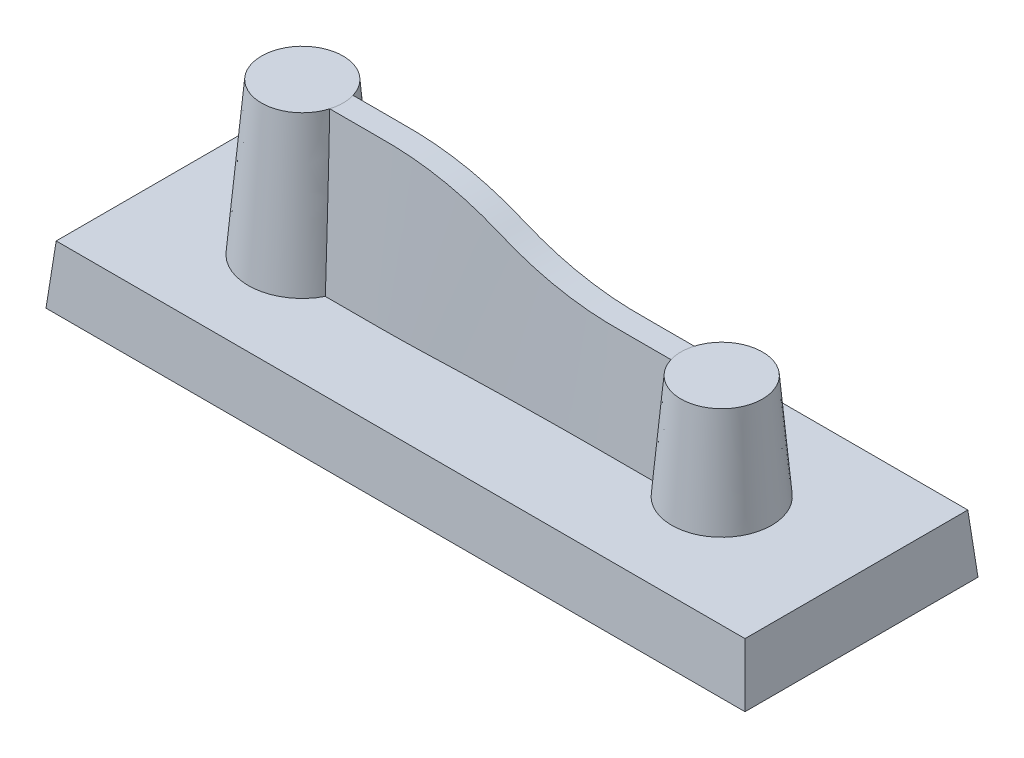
ISO-10303-21;
HEADER;
FILE_DESCRIPTION(('STEP AP214'),'2;1');
FILE_NAME('part.step','',(''),(''),'','','');
FILE_SCHEMA(('AUTOMOTIVE_DESIGN { 1 0 10303 214 1 1 1 1 }'));
ENDSEC;
DATA;
#1=APPLICATION_CONTEXT('core data for automotive mechanical design processes');
#2=APPLICATION_PROTOCOL_DEFINITION('international standard','automotive_design',2000,#1);
#3=PRODUCT_CONTEXT('',#1,'mechanical');
#4=PRODUCT('Part','Part','',(#3));
#5=PRODUCT_RELATED_PRODUCT_CATEGORY('part','',(#4));
#6=PRODUCT_DEFINITION_FORMATION('','',#4);
#7=PRODUCT_DEFINITION_CONTEXT('part definition',#1,'design');
#8=PRODUCT_DEFINITION('design','',#6,#7);
#9=PRODUCT_DEFINITION_SHAPE('','',#8);
#10=(LENGTH_UNIT() NAMED_UNIT(*) SI_UNIT(.MILLI.,.METRE.));
#11=(NAMED_UNIT(*) PLANE_ANGLE_UNIT() SI_UNIT($,.RADIAN.));
#12=(NAMED_UNIT(*) SI_UNIT($,.STERADIAN.) SOLID_ANGLE_UNIT());
#13=UNCERTAINTY_MEASURE_WITH_UNIT(LENGTH_MEASURE(1.E-05),#10,'distance_accuracy_value','');
#14=(GEOMETRIC_REPRESENTATION_CONTEXT(3) GLOBAL_UNCERTAINTY_ASSIGNED_CONTEXT((#13)) GLOBAL_UNIT_ASSIGNED_CONTEXT((#10,
#11,#12)) REPRESENTATION_CONTEXT('',''));
#15=CARTESIAN_POINT('',(0.,0.,0.));
#16=DIRECTION('',(0.,0.,1.));
#17=DIRECTION('',(1.,0.,0.));
#18=AXIS2_PLACEMENT_3D('',#15,#16,#17);
#19=CARTESIAN_POINT('',(150.,0.,-50.));
#20=DIRECTION('',(0.996194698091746,0.0871557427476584,0.));
#21=DIRECTION('',(-0.0871557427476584,0.996194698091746,0.));
#22=AXIS2_PLACEMENT_3D('',#19,#20,#21);
#23=PLANE('',#22);
#24=DIRECTION('',(0.,0.,-1.));
#25=VECTOR('',#24,1.);
#26=CARTESIAN_POINT('',(150.,0.,-50.));
#27=LINE('',#26,#25);
#28=CARTESIAN_POINT('',(150.,0.,50.));
#29=VERTEX_POINT('',#28);
#30=CARTESIAN_POINT('',(150.,0.,-50.));
#31=VERTEX_POINT('',#30);
#32=EDGE_CURVE('E269',#29,#31,#27,.T.);
#33=ORIENTED_EDGE('',*,*,#32,.T.);
#34=DIRECTION('',(0.0868265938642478,-0.992432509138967,-0.0868265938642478));
#35=VECTOR('',#34,1.);
#36=CARTESIAN_POINT('',(147.73834277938,25.8508603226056,-47.7383427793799));
#37=LINE('',#36,#35);
#38=CARTESIAN_POINT('',(147.812783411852,25.,-47.8127834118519));
#39=VERTEX_POINT('',#38);
#40=EDGE_CURVE('E277',#39,#31,#37,.T.);
#41=ORIENTED_EDGE('',*,*,#40,.F.);
#42=DIRECTION('',(0.,0.,1.));
#43=VECTOR('',#42,1.);
#44=CARTESIAN_POINT('',(147.812783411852,25.,-50.));
#45=LINE('',#44,#43);
#46=CARTESIAN_POINT('',(147.812783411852,25.,47.8127834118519));
#47=VERTEX_POINT('',#46);
#48=EDGE_CURVE('E270',#47,#39,#45,.F.);
#49=ORIENTED_EDGE('',*,*,#48,.F.);
#50=DIRECTION('',(0.0868265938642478,-0.992432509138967,0.0868265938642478));
#51=VECTOR('',#50,1.);
#52=CARTESIAN_POINT('',(149.246114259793,8.61695344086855,49.2461142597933));
#53=LINE('',#52,#51);
#54=EDGE_CURVE('E266',#47,#29,#53,.T.);
#55=ORIENTED_EDGE('',*,*,#54,.T.);
#56=EDGE_LOOP('',(#33,#41,#49,#55));
#57=FACE_BOUND('',#56,.T.);
#58=ADVANCED_FACE('F32',(#57),#23,.T.);
#59=CARTESIAN_POINT('',(-150.,0.,-50.));
#60=DIRECTION('',(0.,0.0871557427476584,-0.996194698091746));
#61=DIRECTION('',(0.,0.996194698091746,0.0871557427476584));
#62=AXIS2_PLACEMENT_3D('',#59,#60,#61);
#63=PLANE('',#62);
#64=DIRECTION('',(-1.,0.,0.));
#65=VECTOR('',#64,1.);
#66=CARTESIAN_POINT('',(-150.,0.,-50.));
#67=LINE('',#66,#65);
#68=CARTESIAN_POINT('',(-150.,0.,-50.));
#69=VERTEX_POINT('',#68);
#70=EDGE_CURVE('E261',#31,#69,#67,.T.);
#71=ORIENTED_EDGE('',*,*,#70,.T.);
#72=DIRECTION('',(-0.0868265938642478,-0.992432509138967,-0.0868265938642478));
#73=VECTOR('',#72,1.);
#74=CARTESIAN_POINT('',(-150.,0.,-50.));
#75=LINE('',#74,#73);
#76=CARTESIAN_POINT('',(-147.812783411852,25.,-47.8127834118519));
#77=VERTEX_POINT('',#76);
#78=EDGE_CURVE('E257',#77,#69,#75,.T.);
#79=ORIENTED_EDGE('',*,*,#78,.F.);
#80=DIRECTION('',(1.,0.,0.));
#81=VECTOR('',#80,1.);
#82=CARTESIAN_POINT('',(-150.,25.,-47.8127834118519));
#83=LINE('',#82,#81);
#84=EDGE_CURVE('E273',#39,#77,#83,.F.);
#85=ORIENTED_EDGE('',*,*,#84,.F.);
#86=ORIENTED_EDGE('',*,*,#40,.T.);
#87=EDGE_LOOP('',(#71,#79,#85,#86));
#88=FACE_BOUND('',#87,.T.);
#89=ADVANCED_FACE('F34',(#88),#63,.T.);
#90=CARTESIAN_POINT('',(-150.,0.,-50.));
#91=DIRECTION('',(-0.996194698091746,0.0871557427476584,0.));
#92=DIRECTION('',(-0.0871557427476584,-0.996194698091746,0.));
#93=AXIS2_PLACEMENT_3D('',#90,#91,#92);
#94=PLANE('',#93);
#95=DIRECTION('',(0.,0.,1.));
#96=VECTOR('',#95,1.);
#97=CARTESIAN_POINT('',(-150.,0.,-50.));
#98=LINE('',#97,#96);
#99=CARTESIAN_POINT('',(-150.,0.,50.));
#100=VERTEX_POINT('',#99);
#101=EDGE_CURVE('E251',#69,#100,#98,.T.);
#102=ORIENTED_EDGE('',*,*,#101,.T.);
#103=DIRECTION('',(-0.0868265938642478,-0.992432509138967,0.0868265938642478));
#104=VECTOR('',#103,1.);
#105=CARTESIAN_POINT('',(-150.,0.,50.));
#106=LINE('',#105,#104);
#107=CARTESIAN_POINT('',(-147.812783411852,25.,47.8127834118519));
#108=VERTEX_POINT('',#107);
#109=EDGE_CURVE('E254',#108,#100,#106,.T.);
#110=ORIENTED_EDGE('',*,*,#109,.F.);
#111=DIRECTION('',(0.,0.,-1.));
#112=VECTOR('',#111,1.);
#113=CARTESIAN_POINT('',(-147.812783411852,25.,-50.));
#114=LINE('',#113,#112);
#115=EDGE_CURVE('E283',#77,#108,#114,.F.);
#116=ORIENTED_EDGE('',*,*,#115,.F.);
#117=ORIENTED_EDGE('',*,*,#78,.T.);
#118=EDGE_LOOP('',(#102,#110,#116,#117));
#119=FACE_BOUND('',#118,.T.);
#120=ADVANCED_FACE('F237',(#119),#94,.T.);
#121=CARTESIAN_POINT('',(-150.,0.,50.));
#122=DIRECTION('',(0.,0.0871557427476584,0.996194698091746));
#123=DIRECTION('',(0.,-0.996194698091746,0.0871557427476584));
#124=AXIS2_PLACEMENT_3D('',#121,#122,#123);
#125=PLANE('',#124);
#126=DIRECTION('',(1.,0.,0.));
#127=VECTOR('',#126,1.);
#128=CARTESIAN_POINT('',(-150.,0.,50.));
#129=LINE('',#128,#127);
#130=EDGE_CURVE('E260',#100,#29,#129,.T.);
#131=ORIENTED_EDGE('',*,*,#130,.T.);
#132=ORIENTED_EDGE('',*,*,#54,.F.);
#133=DIRECTION('',(-1.,0.,0.));
#134=VECTOR('',#133,1.);
#135=CARTESIAN_POINT('',(-150.,25.,47.8127834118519));
#136=LINE('',#135,#134);
#137=EDGE_CURVE('E265',#108,#47,#136,.F.);
#138=ORIENTED_EDGE('',*,*,#137,.F.);
#139=ORIENTED_EDGE('',*,*,#109,.T.);
#140=EDGE_LOOP('',(#131,#132,#138,#139));
#141=FACE_BOUND('',#140,.T.);
#142=ADVANCED_FACE('F241',(#141),#125,.T.);
#143=CARTESIAN_POINT('',(0.,25.,0.));
#144=DIRECTION('',(0.,1.,0.));
#145=DIRECTION('',(0.,0.,1.));
#146=AXIS2_PLACEMENT_3D('',#143,#144,#145);
#147=PLANE('',#146);
#148=CARTESIAN_POINT('',(-90.,25.,-10.6867631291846));
#149=CARTESIAN_POINT('',(-82.3982130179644,25.,-10.6867631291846));
#150=CARTESIAN_POINT('',(-74.7964260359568,25.,-10.6867631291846));
#151=CARTESIAN_POINT('',(-63.3937455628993,25.,-10.6867631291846));
#152=CARTESIAN_POINT('',(-59.5928520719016,25.,-10.6867631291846));
#153=CARTESIAN_POINT('',(-54.8417352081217,25.,-10.6867631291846));
#154=CARTESIAN_POINT('',(-53.8915118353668,25.,-10.6867631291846));
#155=CARTESIAN_POINT('',(-52.4661767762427,25.,-10.6867631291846));
#156=CARTESIAN_POINT('',(-51.9910650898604,25.,-10.6867631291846));
#157=CARTESIAN_POINT('',(-51.2783975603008,25.,-10.6867631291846));
#158=CARTESIAN_POINT('',(-51.0408417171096,25.,-10.6867631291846));
#159=CARTESIAN_POINT('',(-50.5657300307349,25.,-10.6867631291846));
#160=CARTESIAN_POINT('',(-50.307201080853,25.0000001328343,-10.6867631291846));
#161=CARTESIAN_POINT('',(-49.8740356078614,24.9999998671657,-10.6867631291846));
#162=CARTESIAN_POINT('',(-49.7065936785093,24.999809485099,-10.6867631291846));
#163=CARTESIAN_POINT('',(-49.3442198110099,24.9989873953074,-10.6867631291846));
#164=CARTESIAN_POINT('',(-49.1702508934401,24.9983558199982,-10.6867631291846));
#165=CARTESIAN_POINT('',(-48.670007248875,24.9957527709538,-10.6867631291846));
#166=CARTESIAN_POINT('',(-48.3653972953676,24.993058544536,-10.6867631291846));
#167=CARTESIAN_POINT('',(-47.8139737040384,24.9858496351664,-10.6867631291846));
#168=CARTESIAN_POINT('',(-47.5671621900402,24.9813350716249,-10.6867631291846));
#169=CARTESIAN_POINT('',(-47.2402542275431,24.9736162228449,-10.6867631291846));
#170=CARTESIAN_POINT('',(-47.1385023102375,24.9708890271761,-10.6867631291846));
#171=CARTESIAN_POINT('',(-46.9494133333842,24.9652385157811,-10.6867631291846));
#172=CARTESIAN_POINT('',(-46.8784739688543,24.9629190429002,-10.6867631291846));
#173=CARTESIAN_POINT('',(-46.6853877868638,24.9558090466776,-10.6867631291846));
#174=CARTESIAN_POINT('',(-46.5559610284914,24.9507180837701,-10.6867631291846));
#175=CARTESIAN_POINT('',(-46.3296823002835,24.9410833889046,-10.6867631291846));
#176=CARTESIAN_POINT('',(-46.2164429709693,24.9359362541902,-10.6867631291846));
#177=CARTESIAN_POINT('',(-45.8764520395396,24.9195039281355,-10.6867631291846));
#178=CARTESIAN_POINT('',(-45.6494274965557,24.90722770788,-10.6867631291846));
#179=CARTESIAN_POINT('',(-44.9674776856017,24.8664264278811,-10.6867631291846));
#180=CARTESIAN_POINT('',(-44.5116763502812,24.8339270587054,-10.6867631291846));
#181=CARTESIAN_POINT('',(-43.1424900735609,24.7205258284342,-10.6867631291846));
#182=CARTESIAN_POINT('',(-42.227327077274,24.6236944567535,-10.6867631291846));
#183=CARTESIAN_POINT('',(-39.4883950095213,24.2704112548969,-10.6867631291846));
#184=CARTESIAN_POINT('',(-37.6773734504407,23.952116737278,-10.6867631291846));
#185=CARTESIAN_POINT('',(-34.1194242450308,23.1566421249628,-10.6867631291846));
#186=CARTESIAN_POINT('',(-32.3490862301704,22.6754196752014,-10.6867631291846));
#187=CARTESIAN_POINT('',(-30.1657034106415,21.9724848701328,-10.6867631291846));
#188=CARTESIAN_POINT('',(-29.7324685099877,21.8275324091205,-10.6867631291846));
#189=CARTESIAN_POINT('',(-29.1005571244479,21.6079815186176,-10.6867631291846));
#190=CARTESIAN_POINT('',(-28.8921209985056,21.5341894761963,-10.6867631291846));
#191=CARTESIAN_POINT('',(-28.582582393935,21.4225612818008,-10.6867631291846));
#192=CARTESIAN_POINT('',(-28.479922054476,21.3851951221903,-10.6867631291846));
#193=CARTESIAN_POINT('',(-28.2756079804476,21.3101437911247,-10.6867631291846));
#194=CARTESIAN_POINT('',(-28.157830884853,21.2664266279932,-10.6867631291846));
#195=CARTESIAN_POINT('',(-27.9877444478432,21.2027951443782,-10.6867631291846));
#196=CARTESIAN_POINT('',(-27.9268932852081,21.1797307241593,-10.6867631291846));
#197=CARTESIAN_POINT('',(-27.756811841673,21.1147077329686,-10.6867631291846));
#198=CARTESIAN_POINT('',(-27.6637170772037,21.078785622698,-10.6867631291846));
#199=CARTESIAN_POINT('',(-27.3603404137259,20.9605860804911,-10.6867631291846));
#200=CARTESIAN_POINT('',(-27.125971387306,20.8678547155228,-10.6867631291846));
#201=CARTESIAN_POINT('',(-26.5932806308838,20.6539646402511,-10.6867631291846));
#202=CARTESIAN_POINT('',(-26.2949616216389,20.5328070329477,-10.6867631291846));
#203=CARTESIAN_POINT('',(-25.7995858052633,20.3298161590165,-10.6867631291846));
#204=CARTESIAN_POINT('',(-25.6264758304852,20.2586150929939,-10.6867631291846));
#205=CARTESIAN_POINT('',(-25.3548235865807,20.1465593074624,-10.6867631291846));
#206=CARTESIAN_POINT('',(-25.2622748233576,20.108331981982,-10.6867631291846));
#207=CARTESIAN_POINT('',(-25.073177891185,20.0301387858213,-10.6867631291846));
#208=CARTESIAN_POINT('',(-24.9878839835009,19.9948352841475,-10.6867631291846));
#209=CARTESIAN_POINT('',(-24.7682751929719,19.9038548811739,-10.6867631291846));
#210=CARTESIAN_POINT('',(-24.6339354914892,19.8482396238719,-10.6867631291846));
#211=CARTESIAN_POINT('',(-24.3836986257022,19.7447645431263,-10.6867631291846));
#212=CARTESIAN_POINT('',(-24.2565472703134,19.6922421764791,-10.6867631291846));
#213=CARTESIAN_POINT('',(-23.8689747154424,19.532369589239,-10.6867631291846));
#214=CARTESIAN_POINT('',(-23.6024355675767,19.4227126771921,-10.6867631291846));
#215=CARTESIAN_POINT('',(-22.7781679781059,19.0849513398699,-10.6867631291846));
#216=CARTESIAN_POINT('',(-22.1957966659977,18.8480364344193,-10.6867631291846));
#217=CARTESIAN_POINT('',(-20.9641932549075,18.3535135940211,-10.6867631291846));
#218=CARTESIAN_POINT('',(-20.3149584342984,18.0959045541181,-10.6867631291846));
#219=CARTESIAN_POINT('',(-19.2899511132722,17.6965482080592,-10.6867631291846));
#220=CARTESIAN_POINT('',(-18.9397548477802,17.5612774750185,-10.6867631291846));
#221=CARTESIAN_POINT('',(-18.2221293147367,17.2869256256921,-10.6867631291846));
#222=CARTESIAN_POINT('',(-17.8385644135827,17.1418082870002,-10.6867631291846));
#223=CARTESIAN_POINT('',(-17.118562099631,16.8724454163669,-10.6867631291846));
#224=CARTESIAN_POINT('',(-16.790833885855,16.7510104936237,-10.6867631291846));
#225=CARTESIAN_POINT('',(-16.103209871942,16.4984234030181,-10.6867631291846));
#226=CARTESIAN_POINT('',(-15.759437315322,16.3733034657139,-10.6867631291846));
#227=CARTESIAN_POINT('',(-14.7282762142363,16.0014382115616,-10.6867631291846));
#228=CARTESIAN_POINT('',(-14.0410445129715,15.7581877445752,-10.6867631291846));
#229=CARTESIAN_POINT('',(-11.9802726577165,15.0421944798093,-10.6867631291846));
#230=CARTESIAN_POINT('',(-10.6108124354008,14.5842286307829,-10.6867631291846));
#231=CARTESIAN_POINT('',(-3.74184493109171,12.3727814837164,-10.6867631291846));
#232=CARTESIAN_POINT('',(1.8584007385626,10.8466648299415,-10.6867631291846));
#233=CARTESIAN_POINT('',(13.2090142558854,8.30893210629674,-10.6867631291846));
#234=CARTESIAN_POINT('',(18.9359929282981,7.30359066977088,-10.6867631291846));
#235=CARTESIAN_POINT('',(27.5579649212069,6.19147916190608,-10.6867631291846));
#236=CARTESIAN_POINT('',(30.438753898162,5.88652214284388,-10.6867631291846));
#237=CARTESIAN_POINT('',(34.7680121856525,5.52795645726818,-10.6867631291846));
#238=CARTESIAN_POINT('',(36.2124451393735,5.42491946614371,-10.6867631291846));
#239=CARTESIAN_POINT('',(38.3808559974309,5.29518273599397,-10.6867631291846));
#240=CARTESIAN_POINT('',(39.1039532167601,5.25607404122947,-10.6867631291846));
#241=CARTESIAN_POINT('',(40.1890072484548,5.20363157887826,-10.6867631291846));
#242=CARTESIAN_POINT('',(40.5507599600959,5.18718754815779,-10.6867631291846));
#243=CARTESIAN_POINT('',(41.2743960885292,5.15637593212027,-10.6867631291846));
#244=CARTESIAN_POINT('',(41.6198920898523,5.14261149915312,-10.6867631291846));
#245=CARTESIAN_POINT('',(42.3765590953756,5.11474955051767,-10.6867631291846));
#246=CARTESIAN_POINT('',(42.7805299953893,5.10130853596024,-10.6867631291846));
#247=CARTESIAN_POINT('',(43.5413196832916,5.07857399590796,-10.6867631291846));
#248=CARTESIAN_POINT('',(43.9145361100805,5.06867637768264,-10.6867631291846));
#249=CARTESIAN_POINT('',(45.0126058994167,5.04274909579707,-10.6867631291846));
#250=CARTESIAN_POINT('',(45.7158765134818,5.03047065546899,-10.6867631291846));
#251=CARTESIAN_POINT('',(47.0647347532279,5.0128366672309,-10.6867631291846));
#252=CARTESIAN_POINT('',(47.7103245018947,5.0074810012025,-10.6867631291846));
#253=CARTESIAN_POINT('',(48.6354113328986,5.00266725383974,-10.6867631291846));
#254=CARTESIAN_POINT('',(48.9365577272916,5.00160290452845,-10.6867631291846));
#255=CARTESIAN_POINT('',(49.5244152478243,5.0002692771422,-10.6867631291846));
#256=CARTESIAN_POINT('',(49.8320893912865,5.00000018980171,-10.6867631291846));
#257=CARTESIAN_POINT('',(50.3491472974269,4.9999998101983,-10.6867631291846));
#258=CARTESIAN_POINT('',(50.5657300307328,5.,-10.6867631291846));
#259=CARTESIAN_POINT('',(51.0408417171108,5.,-10.6867631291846));
#260=CARTESIAN_POINT('',(51.2783975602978,5.,-10.6867631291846));
#261=CARTESIAN_POINT('',(51.9910650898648,5.,-10.6867631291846));
#262=CARTESIAN_POINT('',(52.466176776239,5.,-10.6867631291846));
#263=CARTESIAN_POINT('',(53.891511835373,5.,-10.6867631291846));
#264=CARTESIAN_POINT('',(54.8417352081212,5.,-10.6867631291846));
#265=CARTESIAN_POINT('',(59.5928520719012,5.,-10.6867631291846));
#266=CARTESIAN_POINT('',(63.3937455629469,5.,-10.6867631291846));
#267=CARTESIAN_POINT('',(74.7964260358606,5.,-10.6867631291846));
#268=CARTESIAN_POINT('',(82.3982130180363,5.,-10.6867631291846));
#269=CARTESIAN_POINT('',(90.,5.,-10.6867631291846));
#270=B_SPLINE_CURVE_WITH_KNOTS('',3,(#148,#149,#150,#151,#152,#153,#154,#155,#156,#157,#158,
#159,#160,#161,#162,#163,#164,#165,#166,#167,#168,#169,#170,#171,#172,#173,#174,#175,#176,#177,
#178,#179,#180,#181,#182,#183,#184,#185,#186,#187,#188,#189,#190,#191,#192,#193,#194,#195,#196,
#197,#198,#199,#200,#201,#202,#203,#204,#205,#206,#207,#208,#209,#210,#211,#212,#213,#214,#215,
#216,#217,#218,#219,#220,#221,#222,#223,#224,#225,#226,#227,#228,#229,#230,#231,#232,#233,#234,
#235,#236,#237,#238,#239,#240,#241,#242,#243,#244,#245,#246,#247,#248,#249,#250,#251,#252,#253,
#254,#255,#256,#257,#258,#259,#260,#261,#262,#263,#264,#265,#266,#267,#268,#269),.UNSPECIFIED.,
.F.,.F.,(4,2,2,2,2,2,2,2,2,2,2,2,2,2,2,2,2,2,2,2,2,2,2,2,2,2,2,2,2,2,2,2,2,2,2,2,2,2,2,2,2,2,2,
2,2,2,2,2,2,2,2,2,2,2,2,2,2,2,2,2,4),(0.,0.125,0.1875,0.203125,0.2109375,0.21484375,0.21875,
0.22265625,0.2265625,0.234375,0.2421875,0.24609375,0.25,0.25390625,0.2578125,0.265625,0.28125,
0.3125,0.375,0.4375,0.453125,0.4609375,0.46484375,0.46875,0.47265625,0.4765625,0.484375,
0.4921875,0.49609375,0.498046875,0.5,0.501953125,0.50390625,0.5078125,0.515625,0.5234375,
0.52734375,0.53125,0.53515625,0.5390625,0.546875,0.5625,0.625,0.6875,0.71875,0.734375,0.7421875,
0.74609375,0.75,0.75390625,0.7578125,0.765625,0.7734375,0.77734375,0.78125,0.78515625,0.7890625,
0.796875,0.8125,0.875,1.),.UNSPECIFIED.);
#271=CARTESIAN_POINT('',(-69.4228505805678,25.,-10.6867631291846));
#272=VERTEX_POINT('',#271);
#273=CARTESIAN_POINT('',(-50.0906183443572,25.,-10.6867631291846));
#274=VERTEX_POINT('',#273);
#275=EDGE_CURVE('E55',#272,#274,#270,.T.);
#276=ORIENTED_EDGE('',*,*,#275,.T.);
#277=CARTESIAN_POINT('',(90.,25.,-8.93698985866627));
#278=CARTESIAN_POINT('',(88.1864957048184,25.,-8.93698985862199));
#279=CARTESIAN_POINT('',(86.3729914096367,25.,-8.93698985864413));
#280=CARTESIAN_POINT('',(82.7459553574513,25.,-8.93698985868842));
#281=CARTESIAN_POINT('',(80.9324236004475,25.,-8.93698985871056));
#282=CARTESIAN_POINT('',(77.3053387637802,25.,-8.93698985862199));
#283=CARTESIAN_POINT('',(75.4917856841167,25.,-8.93698985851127));
#284=CARTESIAN_POINT('',(71.8646643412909,25.,-8.93698985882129));
#285=CARTESIAN_POINT('',(70.0510960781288,25.,-8.93698985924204));
#286=CARTESIAN_POINT('',(66.4239505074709,25.,-8.93698985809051));
#287=CARTESIAN_POINT('',(64.6103731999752,25.,-8.93698985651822));
#288=CARTESIAN_POINT('',(60.9832156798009,25.,-8.93698986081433));
#289=CARTESIAN_POINT('',(59.1696354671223,25.,-8.93698986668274));
#290=CARTESIAN_POINT('',(56.4495057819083,25.,-8.9369898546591));
#291=CARTESIAN_POINT('',(55.5429563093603,25.,-8.93698984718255));
#292=CARTESIAN_POINT('',(53.7298572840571,25.,-8.93698987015));
#293=CARTESIAN_POINT('',(52.823307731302,25.,-8.936989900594));
#294=CARTESIAN_POINT('',(51.4634841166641,25.,-8.93698983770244));
#295=CARTESIAN_POINT('',(51.0102100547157,25.,-8.93698979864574));
#296=CARTESIAN_POINT('',(50.103661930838,25.,-8.93698991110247));
#297=CARTESIAN_POINT('',(49.6503878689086,25.,-8.93699006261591));
#298=CARTESIAN_POINT('',(48.2905658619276,25.,-8.93727108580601));
#299=CARTESIAN_POINT('',(47.3840179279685,25.,-8.93783252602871));
#300=CARTESIAN_POINT('',(45.5709312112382,25.,-8.94004869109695));
#301=CARTESIAN_POINT('',(44.6643924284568,25.,-8.94170340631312));
#302=CARTESIAN_POINT('',(42.8513184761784,25.,-8.94644859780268));
#303=CARTESIAN_POINT('',(41.944783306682,25.,-8.94953907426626));
#304=CARTESIAN_POINT('',(40.1317231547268,25.,-8.95697007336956));
#305=CARTESIAN_POINT('',(39.2251981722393,25.,-8.96131058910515));
#306=CARTESIAN_POINT('',(37.4121552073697,25.,-8.97126023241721));
#307=CARTESIAN_POINT('',(36.5056372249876,25.,-8.97686936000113));
#308=CARTESIAN_POINT('',(33.7860952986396,25.,-8.99557995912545));
#309=CARTESIAN_POINT('',(31.9730839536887,25.,-9.01056464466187));
#310=CARTESIAN_POINT('',(28.347098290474,25.,-9.04550463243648));
#311=CARTESIAN_POINT('',(26.5341239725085,25.,-9.06545996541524));
#312=CARTESIAN_POINT('',(22.8089578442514,25.,-9.11150634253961));
#313=CARTESIAN_POINT('',(20.8967694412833,25.,-9.13787354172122));
#314=CARTESIAN_POINT('',(17.0724567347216,25.,-9.19599387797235));
#315=CARTESIAN_POINT('',(15.1603324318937,25.,-9.22774706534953));
#316=CARTESIAN_POINT('',(11.3361687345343,25.,-9.29656658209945));
#317=CARTESIAN_POINT('',(9.4241293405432,25.,-9.3336329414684));
#318=CARTESIAN_POINT('',(5.60015501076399,25.,-9.41293756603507));
#319=CARTESIAN_POINT('',(3.68822007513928,25.,-9.45517583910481));
#320=CARTESIAN_POINT('',(-0.135525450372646,25.,-9.54469755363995));
#321=CARTESIAN_POINT('',(-2.04733604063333,25.,-9.59198097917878));
#322=CARTESIAN_POINT('',(-5.87088132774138,25.,-9.69144472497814));
#323=CARTESIAN_POINT('',(-7.78261602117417,25.,-9.7436251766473));
#324=CARTESIAN_POINT('',(-10.6501120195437,25.,-9.82550898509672));
#325=CARTESIAN_POINT('',(-11.6059252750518,25.,-9.85340574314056));
#326=CARTESIAN_POINT('',(-13.5175164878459,25.,-9.91038204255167));
#327=CARTESIAN_POINT('',(-14.4732944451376,25.,-9.93946158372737));
#328=CARTESIAN_POINT('',(-16.3847940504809,25.,-9.99894495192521));
#329=CARTESIAN_POINT('',(-17.3405156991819,25.,-10.0293487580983));
#330=CARTESIAN_POINT('',(-19.2519266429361,25.,-10.0911725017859));
#331=CARTESIAN_POINT('',(-20.2076159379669,25.,-10.1225924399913));
#332=CARTESIAN_POINT('',(-21.6411163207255,25.,-10.1702127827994));
#333=CARTESIAN_POINT('',(-22.1189356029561,25.,-10.1861676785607));
#334=CARTESIAN_POINT('',(-23.0745728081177,25.,-10.2181226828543));
#335=CARTESIAN_POINT('',(-23.5523907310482,25.,-10.2341227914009));
#336=CARTESIAN_POINT('',(-24.5080347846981,25.,-10.2658562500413));
#337=CARTESIAN_POINT('',(-24.9858609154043,25.,-10.2815896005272));
#338=CARTESIAN_POINT('',(-25.7026130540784,25.,-10.3047881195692));
#339=CARTESIAN_POINT('',(-25.9415325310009,25.,-10.3124540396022));
#340=CARTESIAN_POINT('',(-26.4193803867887,25.,-10.3275031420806));
#341=CARTESIAN_POINT('',(-26.6583087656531,25.,-10.3348863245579));
#342=CARTESIAN_POINT('',(-27.1361599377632,25.,-10.3494036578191));
#343=CARTESIAN_POINT('',(-27.3750827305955,25.,-10.356537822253));
#344=CARTESIAN_POINT('',(-27.8529347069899,25.,-10.3705896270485));
#345=CARTESIAN_POINT('',(-28.0918638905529,25.,-10.3775072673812));
#346=CARTESIAN_POINT('',(-28.808661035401,25.,-10.3979335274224));
#347=CARTESIAN_POINT('',(-29.2865383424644,25.,-10.4111154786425));
#348=CARTESIAN_POINT('',(-30.2423165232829,25.,-10.4366250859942));
#349=CARTESIAN_POINT('',(-30.7202173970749,25.,-10.4489527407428));
#350=CARTESIAN_POINT('',(-31.6760408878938,25.,-10.4727254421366));
#351=CARTESIAN_POINT('',(-32.1539635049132,25.,-10.4841704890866));
#352=CARTESIAN_POINT('',(-33.4283585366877,25.,-10.513497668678));
#353=CARTESIAN_POINT('',(-34.2248494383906,25.,-10.5305862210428));
#354=CARTESIAN_POINT('',(-35.8178809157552,25.,-10.5621840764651));
#355=CARTESIAN_POINT('',(-36.6144214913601,25.,-10.5766933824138));
#356=CARTESIAN_POINT('',(-39.0041182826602,25.,-10.6162625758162));
#357=CARTESIAN_POINT('',(-40.5973433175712,25.,-10.6373635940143));
#358=CARTESIAN_POINT('',(-42.5889492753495,25.,-10.6570036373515));
#359=CARTESIAN_POINT('',(-42.9872850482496,25.,-10.6605949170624));
#360=CARTESIAN_POINT('',(-43.7839622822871,25.,-10.6670949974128));
#361=CARTESIAN_POINT('',(-44.182303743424,25.,-10.670003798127));
#362=CARTESIAN_POINT('',(-44.9789905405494,25.,-10.6751345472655));
#363=CARTESIAN_POINT('',(-45.3773358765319,25.,-10.6773564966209));
#364=CARTESIAN_POINT('',(-45.9748562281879,25.,-10.6801609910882));
#365=CARTESIAN_POINT('',(-46.1740300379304,25.,-10.681007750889));
#366=CARTESIAN_POINT('',(-46.5723782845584,25.,-10.6825360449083));
#367=CARTESIAN_POINT('',(-46.7715527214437,25.,-10.6832175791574));
#368=CARTESIAN_POINT('',(-47.3690997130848,25.,-10.6848889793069));
#369=CARTESIAN_POINT('',(-47.7674732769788,25.,-10.6855055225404));
#370=CARTESIAN_POINT('',(-48.5642208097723,25.,-10.6863441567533));
#371=CARTESIAN_POINT('',(-48.9625947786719,25.,-10.6865662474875));
#372=CARTESIAN_POINT('',(-49.7593433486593,25.,-10.6867777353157));
#373=CARTESIAN_POINT('',(-50.1577179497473,25.,-10.6867671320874));
#374=CARTESIAN_POINT('',(-50.9544670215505,25.,-10.6867591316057));
#375=CARTESIAN_POINT('',(-51.3528414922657,25.,-10.6867617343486));
#376=CARTESIAN_POINT('',(-52.5479880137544,25.,-10.6867659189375));
#377=CARTESIAN_POINT('',(-53.3447600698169,25.,-10.6867638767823));
#378=CARTESIAN_POINT('',(-54.9383036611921,25.,-10.6867623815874));
#379=CARTESIAN_POINT('',(-55.7350751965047,25.,-10.686762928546));
#380=CARTESIAN_POINT('',(-57.3286271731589,25.,-10.6867633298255));
#381=CARTESIAN_POINT('',(-58.1254076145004,25.,-10.6867631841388));
#382=CARTESIAN_POINT('',(-59.7189686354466,25.,-10.6867630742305));
#383=CARTESIAN_POINT('',(-60.5157492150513,25.,-10.6867631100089));
#384=CARTESIAN_POINT('',(-62.9064542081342,25.,-10.6867631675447));
#385=CARTESIAN_POINT('',(-64.5003786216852,25.,-10.6867631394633));
#386=CARTESIAN_POINT('',(-67.6882006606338,25.,-10.6867631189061));
#387=CARTESIAN_POINT('',(-69.2820982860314,25.,-10.6867631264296));
#388=CARTESIAN_POINT('',(-72.469834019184,25.,-10.6867631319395));
#389=CARTESIAN_POINT('',(-74.0636721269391,25.,-10.6867631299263));
#390=CARTESIAN_POINT('',(-77.2512560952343,25.,-10.686763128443));
#391=CARTESIAN_POINT('',(-78.8450019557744,25.,-10.6867631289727));
#392=CARTESIAN_POINT('',(-82.0323687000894,25.,-10.6867631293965));
#393=CARTESIAN_POINT('',(-83.6259895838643,25.,-10.6867631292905));
#394=CARTESIAN_POINT('',(-86.8130736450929,25.,-10.6867631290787));
#395=CARTESIAN_POINT('',(-88.4065368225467,25.,-10.6867631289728));
#396=CARTESIAN_POINT('',(-90.,25.,-10.6867631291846));
#397=B_SPLINE_CURVE_WITH_KNOTS('',3,(#277,#278,#279,#280,#281,#282,#283,#284,#285,#286,#287,
#288,#289,#290,#291,#292,#293,#294,#295,#296,#297,#298,#299,#300,#301,#302,#303,#304,#305,#306,
#307,#308,#309,#310,#311,#312,#313,#314,#315,#316,#317,#318,#319,#320,#321,#322,#323,#324,#325,
#326,#327,#328,#329,#330,#331,#332,#333,#334,#335,#336,#337,#338,#339,#340,#341,#342,#343,#344,
#345,#346,#347,#348,#349,#350,#351,#352,#353,#354,#355,#356,#357,#358,#359,#360,#361,#362,#363,
#364,#365,#366,#367,#368,#369,#370,#371,#372,#373,#374,#375,#376,#377,#378,#379,#380,#381,#382,
#383,#384,#385,#386,#387,#388,#389,#390,#391,#392,#393,#394,#395,#396),.UNSPECIFIED.,.F.,.F.,(4,
2,2,2,2,2,2,2,2,2,2,2,2,2,2,2,2,2,2,2,2,2,2,2,2,2,2,2,2,2,2,2,2,2,2,2,2,2,2,2,2,2,2,2,2,2,2,2,2,
2,2,2,2,2,2,2,2,2,2,4),(0.,5.44051288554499,10.8811081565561,16.3217673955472,21.7624721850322,
27.203204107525,32.6439447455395,35.3635931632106,38.0832418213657,39.4430640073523,
40.8028861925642,43.5225300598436,46.2421499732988,48.9617702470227,51.6813755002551,
54.4009807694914,59.840193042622,65.2794389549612,71.0165416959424,76.7536980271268,
82.4908867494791,88.2280842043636,93.9652635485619,99.7025968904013,102.571257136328,
105.439916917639,108.308531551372,111.177148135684,112.611404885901,114.045662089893,
115.479917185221,116.197044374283,116.914171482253,117.631259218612,118.348347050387,
119.782523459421,121.216702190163,122.650880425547,125.040898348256,127.430913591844,
132.210962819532,133.406018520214,134.601074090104,135.796128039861,136.393654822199,
136.991181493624,138.18630285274,139.381424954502,140.576548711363,141.771672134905,
144.161988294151,146.552302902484,148.942644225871,151.332985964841,156.114759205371,
160.896452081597,165.677966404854,170.459203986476,175.2400666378,180.020456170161),.UNSPECIFIED.);
#398=CARTESIAN_POINT('',(70.5147556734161,25.,-8.93698985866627));
#399=VERTEX_POINT('',#398);
#400=EDGE_CURVE('E209',#399,#274,#397,.T.);
#401=ORIENTED_EDGE('',*,*,#400,.F.);
#402=CARTESIAN_POINT('',(90.,25.,0.));
#403=DIRECTION('',(0.,1.,0.));
#404=DIRECTION('',(0.,0.,1.));
#405=AXIS2_PLACEMENT_3D('',#402,#403,#404);
#406=CIRCLE('',#405,21.4369898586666);
#407=CARTESIAN_POINT('',(70.5147556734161,25.,8.93698985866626));
#408=VERTEX_POINT('',#407);
#409=EDGE_CURVE('E11',#408,#399,#406,.T.);
#410=ORIENTED_EDGE('',*,*,#409,.F.);
#411=CARTESIAN_POINT('',(-90.,25.,10.6867631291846));
#412=CARTESIAN_POINT('',(-87.8240425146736,25.,10.686763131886));
#413=CARTESIAN_POINT('',(-85.6480850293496,25.,10.6867631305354));
#414=CARTESIAN_POINT('',(-81.296003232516,25.,10.6867631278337));
#415=CARTESIAN_POINT('',(-79.1198789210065,25.,10.6867631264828));
#416=CARTESIAN_POINT('',(-74.7675139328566,25.,10.6867631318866));
#417=CARTESIAN_POINT('',(-72.5912732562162,25.,10.6867631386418));
#418=CARTESIAN_POINT('',(-69.3268793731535,25.,10.6867631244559));
#419=CARTESIAN_POINT('',(-68.2387261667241,25.,10.6867631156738));
#420=CARTESIAN_POINT('',(-66.0624195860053,25.,10.6867631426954));
#421=CARTESIAN_POINT('',(-64.9742662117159,25.,10.6867631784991));
#422=CARTESIAN_POINT('',(-62.7979515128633,25.,10.6867630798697));
#423=CARTESIAN_POINT('',(-61.7097901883,25.,10.6867629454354));
#424=CARTESIAN_POINT('',(-59.5334681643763,25.,10.6867633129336));
#425=CARTESIAN_POINT('',(-58.4453074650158,25.,10.6867638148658));
#426=CARTESIAN_POINT('',(-56.2690757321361,25.,10.6867624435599));
#427=CARTESIAN_POINT('',(-55.1810046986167,25.,10.6867605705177));
#428=CARTESIAN_POINT('',(-53.5488970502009,25.,10.6867644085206));
#429=CARTESIAN_POINT('',(-53.0048604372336,25.,10.6867667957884));
#430=CARTESIAN_POINT('',(-51.9167870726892,25.,10.6867594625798));
#431=CARTESIAN_POINT('',(-51.372750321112,25.,10.6867497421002));
#432=CARTESIAN_POINT('',(-50.2846897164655,25.,10.686776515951));
#433=CARTESIAN_POINT('',(-49.7406658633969,25.,10.6868130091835));
#434=CARTESIAN_POINT('',(-48.9246303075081,25.,10.6865250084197));
#435=CARTESIAN_POINT('',(-48.6526185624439,25.,10.6863718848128));
#436=CARTESIAN_POINT('',(-48.1085952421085,25.,10.685896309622));
#437=CARTESIAN_POINT('',(-47.8365836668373,25.,10.6855738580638));
#438=CARTESIAN_POINT('',(-47.2925621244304,25.,10.6846060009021));
#439=CARTESIAN_POINT('',(-47.0205521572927,25.,10.6839605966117));
#440=CARTESIAN_POINT('',(-46.4765335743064,25.,10.6822432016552));
#441=CARTESIAN_POINT('',(-46.2045249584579,25.,10.6811712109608));
#442=CARTESIAN_POINT('',(-45.3885010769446,25.,10.6774928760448));
#443=CARTESIAN_POINT('',(-44.8444878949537,25.,10.6744241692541));
#444=CARTESIAN_POINT('',(-43.2125333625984,25.,10.663277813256));
#445=CARTESIAN_POINT('',(-42.1246046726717,25.,10.6532597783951));
#446=CARTESIAN_POINT('',(-39.9487994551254,25.,10.628246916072));
#447=CARTESIAN_POINT('',(-38.8609229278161,25.,10.6132520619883));
#448=CARTESIAN_POINT('',(-36.6852501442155,25.,10.5783202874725));
#449=CARTESIAN_POINT('',(-35.5974538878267,25.,10.5583833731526));
#450=CARTESIAN_POINT('',(-33.9658361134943,25.,10.5248953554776));
#451=CARTESIAN_POINT('',(-33.4219771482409,25.,10.5131355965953));
#452=CARTESIAN_POINT('',(-32.3342852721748,25.,10.4884558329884));
#453=CARTESIAN_POINT('',(-31.7904523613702,25.,10.4755358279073));
#454=CARTESIAN_POINT('',(-30.7027834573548,25.,10.4485511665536));
#455=CARTESIAN_POINT('',(-30.1589474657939,25.,10.4344864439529));
#456=CARTESIAN_POINT('',(-29.0713053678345,25.,10.4052545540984));
#457=CARTESIAN_POINT('',(-28.527499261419,25.,10.3900873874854));
#458=CARTESIAN_POINT('',(-27.7118143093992,25.,10.3664809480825));
#459=CARTESIAN_POINT('',(-27.4399230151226,25.,10.3584695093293));
#460=CARTESIAN_POINT('',(-26.8961489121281,25.,10.3421640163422));
#461=CARTESIAN_POINT('',(-26.6242661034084,25.,10.3338699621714));
#462=CARTESIAN_POINT('',(-26.0805127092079,25.,10.3168875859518));
#463=CARTESIAN_POINT('',(-25.8086421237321,25.,10.308199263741));
#464=CARTESIAN_POINT('',(-25.2649070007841,25.,10.2906351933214));
#465=CARTESIAN_POINT('',(-24.9930424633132,25.,10.2817594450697));
#466=CARTESIAN_POINT('',(-24.2434674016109,25.,10.2571188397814));
#467=CARTESIAN_POINT('',(-23.7657610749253,25.,10.2412263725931));
#468=CARTESIAN_POINT('',(-22.810352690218,25.,10.2093175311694));
#469=CARTESIAN_POINT('',(-22.3326506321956,25.,10.1933011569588));
#470=CARTESIAN_POINT('',(-21.3772419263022,25.,10.1614201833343));
#471=CARTESIAN_POINT('',(-20.8995352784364,25.,10.1455555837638));
#472=CARTESIAN_POINT('',(-19.9441160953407,25.,10.1140039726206));
#473=CARTESIAN_POINT('',(-19.4664035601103,25.,10.0983169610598));
#474=CARTESIAN_POINT('',(-18.0332430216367,25.,10.0516028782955));
#475=CARTESIAN_POINT('',(-17.0777836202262,25.,10.0209231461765));
#476=CARTESIAN_POINT('',(-15.1668235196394,25.,9.96085765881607));
#477=CARTESIAN_POINT('',(-14.2113228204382,25.,9.93147190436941));
#478=CARTESIAN_POINT('',(-12.3002793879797,25.,9.87391116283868));
#479=CARTESIAN_POINT('',(-11.3447366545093,25.,9.84573618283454));
#480=CARTESIAN_POINT('',(-9.43361680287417,25.,9.79058703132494));
#481=CARTESIAN_POINT('',(-8.47803968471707,25.,9.7636128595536));
#482=CARTESIAN_POINT('',(-5.61125014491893,25.,9.6844969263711));
#483=CARTESIAN_POINT('',(-3.69998750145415,25.,9.63416198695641));
#484=CARTESIAN_POINT('',(0.122667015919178,25.,9.53845006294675));
#485=CARTESIAN_POINT('',(2.03405889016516,25.,9.49307309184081));
#486=CARTESIAN_POINT('',(5.85685276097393,25.,9.40740777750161));
#487=CARTESIAN_POINT('',(7.76825475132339,25.,9.36711915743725));
#488=CARTESIAN_POINT('',(11.5911948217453,25.,9.29176861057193));
#489=CARTESIAN_POINT('',(13.5027329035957,25.,9.25670677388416));
#490=CARTESIAN_POINT('',(17.3259163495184,25.,9.19192439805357));
#491=CARTESIAN_POINT('',(19.2375617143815,25.,9.1622039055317));
#492=CARTESIAN_POINT('',(23.060930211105,25.,9.1081736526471));
#493=CARTESIAN_POINT('',(24.9726533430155,25.,9.08386389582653));
#494=CARTESIAN_POINT('',(28.7961480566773,25.,9.04073094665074));
#495=CARTESIAN_POINT('',(30.707919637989,25.,9.02190771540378));
#496=CARTESIAN_POINT('',(34.2134120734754,25.,8.99248308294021));
#497=CARTESIAN_POINT('',(35.807125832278,25.,8.98103479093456));
#498=CARTESIAN_POINT('',(38.1977066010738,25.,8.96679199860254));
#499=CARTESIAN_POINT('',(38.9945650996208,25.,8.96253268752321));
#500=CARTESIAN_POINT('',(40.5882866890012,25.,8.95498124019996));
#501=CARTESIAN_POINT('',(41.3851497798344,25.,8.95168910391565));
#502=CARTESIAN_POINT('',(42.9788772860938,25.,8.94613127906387));
#503=CARTESIAN_POINT('',(43.7757417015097,25.,8.94386558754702));
#504=CARTESIAN_POINT('',(45.3694727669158,25.,8.94040162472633));
#505=CARTESIAN_POINT('',(46.166339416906,25.,8.93920335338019));
#506=CARTESIAN_POINT('',(47.7600747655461,25.,8.93759537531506));
#507=CARTESIAN_POINT('',(48.5569434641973,25.,8.9371856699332));
#508=CARTESIAN_POINT('',(49.7522465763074,25.,8.93698616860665));
#509=CARTESIAN_POINT('',(50.1506809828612,25.,8.93698884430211));
#510=CARTESIAN_POINT('',(50.947549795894,25.,8.93699086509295));
#511=CARTESIAN_POINT('',(51.345984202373,25.,8.93699021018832));
#512=CARTESIAN_POINT('',(52.5412876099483,25.,8.93698915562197));
#513=CARTESIAN_POINT('',(53.3381566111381,25.,8.93698966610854));
#514=CARTESIAN_POINT('',(54.9318945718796,25.,8.93699005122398));
#515=CARTESIAN_POINT('',(55.7287635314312,25.,8.93698992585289));
#516=CARTESIAN_POINT('',(58.1193697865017,25.,8.93698972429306));
#517=CARTESIAN_POINT('',(59.7131070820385,25.,8.93698982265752));
#518=CARTESIAN_POINT('',(62.9009140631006,25.,8.93698989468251));
#519=CARTESIAN_POINT('',(64.4949837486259,25.,8.93698986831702));
#520=CARTESIAN_POINT('',(67.6831226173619,25.,8.9369898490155));
#521=CARTESIAN_POINT('',(69.2771918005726,25.,8.93698985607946));
#522=CARTESIAN_POINT('',(72.465328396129,25.,8.93698986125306));
#523=CARTESIAN_POINT('',(74.0593958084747,25.,8.93698985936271));
#524=CARTESIAN_POINT('',(77.2475275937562,25.,8.93698985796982));
#525=CARTESIAN_POINT('',(78.8415919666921,25.,8.93698985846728));
#526=CARTESIAN_POINT('',(82.0297164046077,25.,8.93698985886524));
#527=CARTESIAN_POINT('',(83.6237764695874,25.,8.93698985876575));
#528=CARTESIAN_POINT('',(86.8118910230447,25.,8.93698985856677));
#529=CARTESIAN_POINT('',(88.4059455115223,25.,8.93698985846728));
#530=CARTESIAN_POINT('',(90.,25.,8.93698985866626));
#531=B_SPLINE_CURVE_WITH_KNOTS('',3,(#411,#412,#413,#414,#415,#416,#417,#418,#419,#420,#421,
#422,#423,#424,#425,#426,#427,#428,#429,#430,#431,#432,#433,#434,#435,#436,#437,#438,#439,#440,
#441,#442,#443,#444,#445,#446,#447,#448,#449,#450,#451,#452,#453,#454,#455,#456,#457,#458,#459,
#460,#461,#462,#463,#464,#465,#466,#467,#468,#469,#470,#471,#472,#473,#474,#475,#476,#477,#478,
#479,#480,#481,#482,#483,#484,#485,#486,#487,#488,#489,#490,#491,#492,#493,#494,#495,#496,#497,
#498,#499,#500,#501,#502,#503,#504,#505,#506,#507,#508,#509,#510,#511,#512,#513,#514,#515,#516,
#517,#518,#519,#520,#521,#522,#523,#524,#525,#526,#527,#528,#529,#530),.UNSPECIFIED.,.F.,.F.,(4,
2,2,2,2,2,2,2,2,2,2,2,2,2,2,2,2,2,2,2,2,2,2,2,2,2,2,2,2,2,2,2,2,2,2,2,2,2,2,2,2,2,2,2,2,2,2,2,2,
2,2,2,2,2,2,2,2,2,2,4),(0.,6.52787245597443,13.0562453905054,19.5849674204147,22.8494270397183,
26.1138871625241,29.3783711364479,32.6428532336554,35.9070663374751,37.5391761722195,
39.1712864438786,40.8033579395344,41.6193932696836,42.4354284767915,43.2514603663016,
44.0674923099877,45.6995565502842,48.963467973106,52.2273968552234,55.4913217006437,
57.1232789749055,58.7552367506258,60.3872891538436,62.0193406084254,62.8353684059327,
63.6513960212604,64.4674239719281,65.2834521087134,66.7173638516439,68.1512753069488,
69.5851852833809,71.0190953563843,73.8869501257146,76.7548066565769,79.6226799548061,
82.4905526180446,88.2263218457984,93.9621066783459,99.6975793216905,105.433150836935,
111.16877241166,116.90439774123,122.639982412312,127.4212420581,129.811851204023,
132.20246025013,134.59306242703,136.983664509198,139.374270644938,140.569573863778,
141.764877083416,144.155484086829,146.546090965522,151.327302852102,156.109511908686,
160.891719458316,165.673921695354,170.456114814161,175.2382950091,180.020458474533),.UNSPECIFIED.);
#532=CARTESIAN_POINT('',(-50.0906183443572,25.,10.6867631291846));
#533=VERTEX_POINT('',#532);
#534=EDGE_CURVE('E48',#533,#408,#531,.T.);
#535=ORIENTED_EDGE('',*,*,#534,.F.);
#536=CARTESIAN_POINT('',(-90.,25.,10.6867631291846));
#537=CARTESIAN_POINT('',(-82.3982130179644,25.,10.6867631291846));
#538=CARTESIAN_POINT('',(-74.7964260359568,25.,10.6867631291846));
#539=CARTESIAN_POINT('',(-63.3937455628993,25.,10.6867631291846));
#540=CARTESIAN_POINT('',(-59.5928520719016,25.,10.6867631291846));
#541=CARTESIAN_POINT('',(-54.8417352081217,25.,10.6867631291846));
#542=CARTESIAN_POINT('',(-53.8915118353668,25.,10.6867631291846));
#543=CARTESIAN_POINT('',(-52.4661767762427,25.,10.6867631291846));
#544=CARTESIAN_POINT('',(-51.9910650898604,25.,10.6867631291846));
#545=CARTESIAN_POINT('',(-51.2783975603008,25.,10.6867631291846));
#546=CARTESIAN_POINT('',(-51.0408417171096,25.,10.6867631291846));
#547=CARTESIAN_POINT('',(-50.5657300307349,25.,10.6867631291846));
#548=CARTESIAN_POINT('',(-50.307201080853,25.0000001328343,10.6867631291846));
#549=CARTESIAN_POINT('',(-49.8740356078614,24.9999998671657,10.6867631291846));
#550=CARTESIAN_POINT('',(-49.7065936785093,24.999809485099,10.6867631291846));
#551=CARTESIAN_POINT('',(-49.3442198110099,24.9989873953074,10.6867631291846));
#552=CARTESIAN_POINT('',(-49.1702508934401,24.9983558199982,10.6867631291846));
#553=CARTESIAN_POINT('',(-48.670007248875,24.9957527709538,10.6867631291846));
#554=CARTESIAN_POINT('',(-48.3653972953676,24.993058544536,10.6867631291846));
#555=CARTESIAN_POINT('',(-47.8139737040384,24.9858496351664,10.6867631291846));
#556=CARTESIAN_POINT('',(-47.5671621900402,24.9813350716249,10.6867631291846));
#557=CARTESIAN_POINT('',(-47.2402542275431,24.9736162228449,10.6867631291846));
#558=CARTESIAN_POINT('',(-47.1385023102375,24.9708890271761,10.6867631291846));
#559=CARTESIAN_POINT('',(-46.9494133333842,24.9652385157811,10.6867631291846));
#560=CARTESIAN_POINT('',(-46.8784739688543,24.9629190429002,10.6867631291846));
#561=CARTESIAN_POINT('',(-46.6853877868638,24.9558090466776,10.6867631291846));
#562=CARTESIAN_POINT('',(-46.5559610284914,24.9507180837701,10.6867631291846));
#563=CARTESIAN_POINT('',(-46.3296823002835,24.9410833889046,10.6867631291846));
#564=CARTESIAN_POINT('',(-46.2164429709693,24.9359362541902,10.6867631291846));
#565=CARTESIAN_POINT('',(-45.8764520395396,24.9195039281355,10.6867631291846));
#566=CARTESIAN_POINT('',(-45.6494274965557,24.90722770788,10.6867631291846));
#567=CARTESIAN_POINT('',(-44.9674776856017,24.8664264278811,10.6867631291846));
#568=CARTESIAN_POINT('',(-44.5116763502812,24.8339270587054,10.6867631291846));
#569=CARTESIAN_POINT('',(-43.1424900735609,24.7205258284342,10.6867631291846));
#570=CARTESIAN_POINT('',(-42.227327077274,24.6236944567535,10.6867631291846));
#571=CARTESIAN_POINT('',(-39.4883950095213,24.2704112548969,10.6867631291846));
#572=CARTESIAN_POINT('',(-37.6773734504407,23.952116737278,10.6867631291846));
#573=CARTESIAN_POINT('',(-34.1194242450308,23.1566421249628,10.6867631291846));
#574=CARTESIAN_POINT('',(-32.3490862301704,22.6754196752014,10.6867631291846));
#575=CARTESIAN_POINT('',(-30.1657034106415,21.9724848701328,10.6867631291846));
#576=CARTESIAN_POINT('',(-29.7324685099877,21.8275324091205,10.6867631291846));
#577=CARTESIAN_POINT('',(-29.1005571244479,21.6079815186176,10.6867631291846));
#578=CARTESIAN_POINT('',(-28.8921209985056,21.5341894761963,10.6867631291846));
#579=CARTESIAN_POINT('',(-28.582582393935,21.4225612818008,10.6867631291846));
#580=CARTESIAN_POINT('',(-28.479922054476,21.3851951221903,10.6867631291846));
#581=CARTESIAN_POINT('',(-28.2756079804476,21.3101437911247,10.6867631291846));
#582=CARTESIAN_POINT('',(-28.157830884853,21.2664266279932,10.6867631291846));
#583=CARTESIAN_POINT('',(-27.9877444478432,21.2027951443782,10.6867631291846));
#584=CARTESIAN_POINT('',(-27.9268932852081,21.1797307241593,10.6867631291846));
#585=CARTESIAN_POINT('',(-27.756811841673,21.1147077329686,10.6867631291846));
#586=CARTESIAN_POINT('',(-27.6637170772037,21.078785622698,10.6867631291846));
#587=CARTESIAN_POINT('',(-27.3603404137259,20.9605860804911,10.6867631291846));
#588=CARTESIAN_POINT('',(-27.125971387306,20.8678547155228,10.6867631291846));
#589=CARTESIAN_POINT('',(-26.5932806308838,20.6539646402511,10.6867631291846));
#590=CARTESIAN_POINT('',(-26.2949616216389,20.5328070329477,10.6867631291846));
#591=CARTESIAN_POINT('',(-25.7995858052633,20.3298161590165,10.6867631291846));
#592=CARTESIAN_POINT('',(-25.6264758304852,20.2586150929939,10.6867631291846));
#593=CARTESIAN_POINT('',(-25.3548235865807,20.1465593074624,10.6867631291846));
#594=CARTESIAN_POINT('',(-25.2622748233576,20.108331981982,10.6867631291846));
#595=CARTESIAN_POINT('',(-25.073177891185,20.0301387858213,10.6867631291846));
#596=CARTESIAN_POINT('',(-24.9878839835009,19.9948352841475,10.6867631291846));
#597=CARTESIAN_POINT('',(-24.7682751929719,19.9038548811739,10.6867631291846));
#598=CARTESIAN_POINT('',(-24.6339354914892,19.8482396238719,10.6867631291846));
#599=CARTESIAN_POINT('',(-24.3836986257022,19.7447645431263,10.6867631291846));
#600=CARTESIAN_POINT('',(-24.2565472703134,19.6922421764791,10.6867631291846));
#601=CARTESIAN_POINT('',(-23.8689747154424,19.532369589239,10.6867631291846));
#602=CARTESIAN_POINT('',(-23.6024355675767,19.4227126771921,10.6867631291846));
#603=CARTESIAN_POINT('',(-22.7781679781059,19.0849513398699,10.6867631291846));
#604=CARTESIAN_POINT('',(-22.1957966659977,18.8480364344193,10.6867631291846));
#605=CARTESIAN_POINT('',(-20.9641932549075,18.3535135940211,10.6867631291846));
#606=CARTESIAN_POINT('',(-20.3149584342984,18.0959045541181,10.6867631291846));
#607=CARTESIAN_POINT('',(-19.2899511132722,17.6965482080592,10.6867631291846));
#608=CARTESIAN_POINT('',(-18.9397548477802,17.5612774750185,10.6867631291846));
#609=CARTESIAN_POINT('',(-18.2221293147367,17.2869256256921,10.6867631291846));
#610=CARTESIAN_POINT('',(-17.8385644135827,17.1418082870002,10.6867631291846));
#611=CARTESIAN_POINT('',(-17.118562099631,16.8724454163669,10.6867631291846));
#612=CARTESIAN_POINT('',(-16.790833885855,16.7510104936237,10.6867631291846));
#613=CARTESIAN_POINT('',(-16.103209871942,16.4984234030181,10.6867631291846));
#614=CARTESIAN_POINT('',(-15.759437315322,16.3733034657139,10.6867631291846));
#615=CARTESIAN_POINT('',(-14.7282762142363,16.0014382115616,10.6867631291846));
#616=CARTESIAN_POINT('',(-14.0410445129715,15.7581877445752,10.6867631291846));
#617=CARTESIAN_POINT('',(-11.9802726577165,15.0421944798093,10.6867631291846));
#618=CARTESIAN_POINT('',(-10.6108124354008,14.5842286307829,10.6867631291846));
#619=CARTESIAN_POINT('',(-3.74184493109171,12.3727814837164,10.6867631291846));
#620=CARTESIAN_POINT('',(1.8584007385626,10.8466648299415,10.6867631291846));
#621=CARTESIAN_POINT('',(13.2090142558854,8.30893210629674,10.6867631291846));
#622=CARTESIAN_POINT('',(18.9359929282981,7.30359066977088,10.6867631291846));
#623=CARTESIAN_POINT('',(27.5579649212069,6.19147916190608,10.6867631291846));
#624=CARTESIAN_POINT('',(30.438753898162,5.88652214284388,10.6867631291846));
#625=CARTESIAN_POINT('',(34.7680121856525,5.52795645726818,10.6867631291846));
#626=CARTESIAN_POINT('',(36.2124451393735,5.42491946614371,10.6867631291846));
#627=CARTESIAN_POINT('',(38.3808559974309,5.29518273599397,10.6867631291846));
#628=CARTESIAN_POINT('',(39.1039532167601,5.25607404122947,10.6867631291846));
#629=CARTESIAN_POINT('',(40.1890072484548,5.20363157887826,10.6867631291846));
#630=CARTESIAN_POINT('',(40.5507599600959,5.18718754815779,10.6867631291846));
#631=CARTESIAN_POINT('',(41.2743960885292,5.15637593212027,10.6867631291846));
#632=CARTESIAN_POINT('',(41.6198920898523,5.14261149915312,10.6867631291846));
#633=CARTESIAN_POINT('',(42.3765590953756,5.11474955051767,10.6867631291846));
#634=CARTESIAN_POINT('',(42.7805299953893,5.10130853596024,10.6867631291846));
#635=CARTESIAN_POINT('',(43.5413196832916,5.07857399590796,10.6867631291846));
#636=CARTESIAN_POINT('',(43.9145361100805,5.06867637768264,10.6867631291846));
#637=CARTESIAN_POINT('',(45.0126058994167,5.04274909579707,10.6867631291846));
#638=CARTESIAN_POINT('',(45.7158765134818,5.03047065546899,10.6867631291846));
#639=CARTESIAN_POINT('',(47.0647347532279,5.0128366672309,10.6867631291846));
#640=CARTESIAN_POINT('',(47.7103245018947,5.0074810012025,10.6867631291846));
#641=CARTESIAN_POINT('',(48.6354113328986,5.00266725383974,10.6867631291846));
#642=CARTESIAN_POINT('',(48.9365577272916,5.00160290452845,10.6867631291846));
#643=CARTESIAN_POINT('',(49.5244152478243,5.0002692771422,10.6867631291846));
#644=CARTESIAN_POINT('',(49.8320893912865,5.00000018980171,10.6867631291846));
#645=CARTESIAN_POINT('',(50.3491472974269,4.9999998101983,10.6867631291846));
#646=CARTESIAN_POINT('',(50.5657300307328,5.,10.6867631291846));
#647=CARTESIAN_POINT('',(51.0408417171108,5.,10.6867631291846));
#648=CARTESIAN_POINT('',(51.2783975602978,5.,10.6867631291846));
#649=CARTESIAN_POINT('',(51.9910650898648,5.,10.6867631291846));
#650=CARTESIAN_POINT('',(52.466176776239,5.,10.6867631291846));
#651=CARTESIAN_POINT('',(53.891511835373,5.,10.6867631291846));
#652=CARTESIAN_POINT('',(54.8417352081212,5.,10.6867631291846));
#653=CARTESIAN_POINT('',(59.5928520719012,5.,10.6867631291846));
#654=CARTESIAN_POINT('',(63.3937455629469,5.,10.6867631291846));
#655=CARTESIAN_POINT('',(74.7964260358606,5.,10.6867631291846));
#656=CARTESIAN_POINT('',(82.3982130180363,5.,10.6867631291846));
#657=CARTESIAN_POINT('',(90.,5.,10.6867631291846));
#658=B_SPLINE_CURVE_WITH_KNOTS('',3,(#536,#537,#538,#539,#540,#541,#542,#543,#544,#545,#546,
#547,#548,#549,#550,#551,#552,#553,#554,#555,#556,#557,#558,#559,#560,#561,#562,#563,#564,#565,
#566,#567,#568,#569,#570,#571,#572,#573,#574,#575,#576,#577,#578,#579,#580,#581,#582,#583,#584,
#585,#586,#587,#588,#589,#590,#591,#592,#593,#594,#595,#596,#597,#598,#599,#600,#601,#602,#603,
#604,#605,#606,#607,#608,#609,#610,#611,#612,#613,#614,#615,#616,#617,#618,#619,#620,#621,#622,
#623,#624,#625,#626,#627,#628,#629,#630,#631,#632,#633,#634,#635,#636,#637,#638,#639,#640,#641,
#642,#643,#644,#645,#646,#647,#648,#649,#650,#651,#652,#653,#654,#655,#656,#657),.UNSPECIFIED.,
.F.,.F.,(4,2,2,2,2,2,2,2,2,2,2,2,2,2,2,2,2,2,2,2,2,2,2,2,2,2,2,2,2,2,2,2,2,2,2,2,2,2,2,2,2,2,2,
2,2,2,2,2,2,2,2,2,2,2,2,2,2,2,2,2,4),(0.,0.125,0.1875,0.203125,0.2109375,0.21484375,0.21875,
0.22265625,0.2265625,0.234375,0.2421875,0.24609375,0.25,0.25390625,0.2578125,0.265625,0.28125,
0.3125,0.375,0.4375,0.453125,0.4609375,0.46484375,0.46875,0.47265625,0.4765625,0.484375,
0.4921875,0.49609375,0.498046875,0.5,0.501953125,0.50390625,0.5078125,0.515625,0.5234375,
0.52734375,0.53125,0.53515625,0.5390625,0.546875,0.5625,0.625,0.6875,0.71875,0.734375,0.7421875,
0.74609375,0.75,0.75390625,0.7578125,0.765625,0.7734375,0.77734375,0.78125,0.78515625,0.7890625,
0.796875,0.8125,0.875,1.),.UNSPECIFIED.);
#659=CARTESIAN_POINT('',(-69.4228505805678,25.,10.6867631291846));
#660=VERTEX_POINT('',#659);
#661=EDGE_CURVE('E127',#660,#533,#658,.T.);
#662=ORIENTED_EDGE('',*,*,#661,.F.);
#663=CARTESIAN_POINT('',(-90.,25.,0.));
#664=DIRECTION('',(0.,1.,0.));
#665=DIRECTION('',(0.,0.,1.));
#666=AXIS2_PLACEMENT_3D('',#663,#664,#665);
#667=CIRCLE('',#666,23.1867631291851);
#668=EDGE_CURVE('E36',#272,#660,#667,.T.);
#669=ORIENTED_EDGE('',*,*,#668,.F.);
#670=EDGE_LOOP('',(#276,#401,#410,#535,#662,#669));
#671=FACE_BOUND('',#670,.T.);
#672=ORIENTED_EDGE('',*,*,#48,.T.);
#673=ORIENTED_EDGE('',*,*,#84,.T.);
#674=ORIENTED_EDGE('',*,*,#115,.T.);
#675=ORIENTED_EDGE('',*,*,#137,.T.);
#676=EDGE_LOOP('',(#672,#673,#674,#675));
#677=FACE_BOUND('',#676,.T.);
#678=ADVANCED_FACE('F199',(#671,#677),#147,.T.);
#679=CARTESIAN_POINT('',(0.,0.,0.));
#680=DIRECTION('',(0.,1.,0.));
#681=DIRECTION('',(0.,0.,1.));
#682=AXIS2_PLACEMENT_3D('',#679,#680,#681);
#683=PLANE('',#682);
#684=ORIENTED_EDGE('',*,*,#32,.F.);
#685=ORIENTED_EDGE('',*,*,#130,.F.);
#686=ORIENTED_EDGE('',*,*,#101,.F.);
#687=ORIENTED_EDGE('',*,*,#70,.F.);
#688=EDGE_LOOP('',(#684,#685,#686,#687));
#689=FACE_BOUND('',#688,.T.);
#690=ADVANCED_FACE('F197',(#689),#683,.F.);
#691=CARTESIAN_POINT('',(-90.,90.,0.));
#692=DIRECTION('',(0.,-1.,0.));
#693=DIRECTION('',(0.,0.,1.));
#694=AXIS2_PLACEMENT_3D('',#691,#692,#693);
#695=CONICAL_SURFACE('',#694,17.5,0.0872664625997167);
#696=CARTESIAN_POINT('',(-69.4228505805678,25.,-10.6867631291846));
#697=CARTESIAN_POINT('',(-69.610798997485,28.5361748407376,-10.3773879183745));
#698=CARTESIAN_POINT('',(-69.8012912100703,32.0722163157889,-10.0680243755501));
#699=CARTESIAN_POINT('',(-70.1878679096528,39.1440010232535,-9.44932338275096));
#700=CARTESIAN_POINT('',(-70.3839524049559,42.6797442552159,-9.13998593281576));
#701=CARTESIAN_POINT('',(-70.7886384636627,49.8648884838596,-8.51136726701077));
#702=CARTESIAN_POINT('',(-70.9974397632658,53.5142783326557,-8.19208702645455));
#703=CARTESIAN_POINT('',(-71.4222129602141,60.8126413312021,-7.55356300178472));
#704=CARTESIAN_POINT('',(-71.6381848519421,64.4616144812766,-7.23431921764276));
#705=CARTESIAN_POINT('',(-72.0780813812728,71.7591509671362,-6.59586750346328));
#706=CARTESIAN_POINT('',(-72.3020061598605,75.4077142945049,-6.27665957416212));
#707=CARTESIAN_POINT('',(-72.7587956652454,82.7042912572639,-5.63829180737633));
#708=CARTESIAN_POINT('',(-72.9916604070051,86.3523048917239,-5.3191319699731));
#709=CARTESIAN_POINT('',(-73.2294901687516,90.,-5.));
#710=B_SPLINE_CURVE_WITH_KNOTS('',3,(#696,#697,#698,#699,#700,#701,#702,#703,#704,#705,#706,
#707,#708,#709),.UNSPECIFIED.,.F.,.F.,(4,2,2,2,2,2,4),(0.,10.6639644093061,21.3279446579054,
32.3357652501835,43.3435772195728,54.3515844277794,65.3596100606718),.UNSPECIFIED.);
#711=CARTESIAN_POINT('',(-73.2294901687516,90.,-5.));
#712=VERTEX_POINT('',#711);
#713=EDGE_CURVE('E121',#272,#712,#710,.T.);
#714=ORIENTED_EDGE('',*,*,#713,.F.);
#715=ORIENTED_EDGE('',*,*,#668,.T.);
#716=CARTESIAN_POINT('',(-73.2294901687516,90.,5.));
#717=CARTESIAN_POINT('',(-73.0555833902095,87.3329602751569,5.23333574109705));
#718=CARTESIAN_POINT('',(-72.8843479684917,84.6657485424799,5.46668653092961));
#719=CARTESIAN_POINT('',(-72.546806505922,79.3310167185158,5.93341508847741));
#720=CARTESIAN_POINT('',(-72.3805004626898,76.6634966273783,6.16679285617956));
#721=CARTESIAN_POINT('',(-72.0524047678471,71.3281894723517,6.6335717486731));
#722=CARTESIAN_POINT('',(-71.8906151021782,68.6604024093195,6.86697287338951));
#723=CARTESIAN_POINT('',(-71.571206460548,63.3245805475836,7.33379679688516));
#724=CARTESIAN_POINT('',(-71.4135874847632,60.6565457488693,7.56721959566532));
#725=CARTESIAN_POINT('',(-71.0975182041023,55.2397947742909,8.04112389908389));
#726=CARTESIAN_POINT('',(-70.9391861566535,52.4910717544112,8.28160600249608));
#727=CARTESIAN_POINT('',(-70.6263273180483,46.9934099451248,8.76258908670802));
#728=CARTESIAN_POINT('',(-70.4718005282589,44.2444711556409,9.00309006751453));
#729=CARTESIAN_POINT('',(-70.1662883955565,38.7463789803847,9.48411080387));
#730=CARTESIAN_POINT('',(-70.0153030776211,35.997225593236,9.72463055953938));
#731=CARTESIAN_POINT('',(-69.7166474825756,30.4987418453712,10.205685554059));
#732=CARTESIAN_POINT('',(-69.5689772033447,27.7494114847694,10.4462207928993));
#733=CARTESIAN_POINT('',(-69.4228505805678,25.,10.6867631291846));
#734=B_SPLINE_CURVE_WITH_KNOTS('',3,(#716,#717,#718,#719,#720,#721,#722,#723,#724,#725,#726,
#727,#728,#729,#730,#731,#732,#733),.UNSPECIFIED.,.F.,.F.,(4,2,2,2,2,2,2,2,4),(0.,
8.04860662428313,16.0972093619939,24.1457870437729,32.1943650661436,40.4856474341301,
48.7769327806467,57.0682765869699,65.3596150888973),.UNSPECIFIED.);
#735=CARTESIAN_POINT('',(-73.2294901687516,90.,5.));
#736=VERTEX_POINT('',#735);
#737=EDGE_CURVE('E181',#736,#660,#734,.T.);
#738=ORIENTED_EDGE('',*,*,#737,.F.);
#739=CARTESIAN_POINT('',(-90.,90.,0.));
#740=DIRECTION('',(0.,1.,0.));
#741=DIRECTION('',(0.,0.,1.));
#742=AXIS2_PLACEMENT_3D('',#739,#740,#741);
#743=CIRCLE('',#742,17.5);
#744=EDGE_CURVE('E113',#712,#736,#743,.T.);
#745=ORIENTED_EDGE('',*,*,#744,.F.);
#746=EDGE_LOOP('',(#714,#715,#738,#745));
#747=FACE_BOUND('',#746,.T.);
#748=ADVANCED_FACE('F193',(#747),#695,.T.);
#749=CARTESIAN_POINT('',(-90.,90.,0.));
#750=DIRECTION('',(0.,1.,0.));
#751=DIRECTION('',(0.,0.,1.));
#752=AXIS2_PLACEMENT_3D('',#749,#750,#751);
#753=PLANE('',#752);
#754=EDGE_CURVE('E132',#736,#712,#743,.T.);
#755=ORIENTED_EDGE('',*,*,#754,.T.);
#756=ORIENTED_EDGE('',*,*,#744,.T.);
#757=EDGE_LOOP('',(#755,#756));
#758=FACE_BOUND('',#757,.T.);
#759=ADVANCED_FACE('F196',(#758),#753,.T.);
#760=CARTESIAN_POINT('',(90.,70.,0.));
#761=DIRECTION('',(0.,-1.,0.));
#762=DIRECTION('',(0.,0.,1.));
#763=AXIS2_PLACEMENT_3D('',#760,#761,#762);
#764=CONICAL_SURFACE('',#763,17.5,0.0872664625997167);
#765=CARTESIAN_POINT('',(73.2294901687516,70.,-5.00000000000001));
#766=CARTESIAN_POINT('',(73.0555830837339,67.3329556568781,-5.23333614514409));
#767=CARTESIAN_POINT('',(72.8843473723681,64.6657392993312,-5.46668733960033));
#768=CARTESIAN_POINT('',(72.5468053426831,59.3309981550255,-5.93341671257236));
#769=CARTESIAN_POINT('',(72.3804990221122,56.6634733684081,-6.16679489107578));
#770=CARTESIAN_POINT('',(72.0524033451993,51.3281661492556,-6.63357378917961));
#771=CARTESIAN_POINT('',(71.8906139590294,48.6603837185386,-6.86697450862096));
#772=CARTESIAN_POINT('',(71.5712059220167,43.3245711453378,-7.33379761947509));
#773=CARTESIAN_POINT('',(71.4135872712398,40.6565410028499,-7.56722001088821));
#774=CARTESIAN_POINT('',(71.1315955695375,35.8238087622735,-7.99002929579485));
#775=CARTESIAN_POINT('',(71.0065622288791,33.6591448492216,-8.17941284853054));
#776=CARTESIAN_POINT('',(70.7588949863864,29.3296748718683,-8.55819239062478));
#777=CARTESIAN_POINT('',(70.63626109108,27.1648688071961,-8.74758838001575));
#778=CARTESIAN_POINT('',(70.5147556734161,25.,-8.93698985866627));
#779=B_SPLINE_CURVE_WITH_KNOTS('',3,(#765,#766,#767,#768,#769,#770,#771,#772,#773,#774,#775,
#776,#777,#778),.UNSPECIFIED.,.F.,.F.,(4,2,2,2,2,2,4),(0.,8.04862057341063,16.0972374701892,
24.1458012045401,32.1943650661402,38.7239444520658,45.2535416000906),.UNSPECIFIED.);
#780=CARTESIAN_POINT('',(73.2294901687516,70.,-5.));
#781=VERTEX_POINT('',#780);
#782=EDGE_CURVE('E120',#781,#399,#779,.T.);
#783=ORIENTED_EDGE('',*,*,#782,.F.);
#784=CARTESIAN_POINT('',(90.,70.,0.));
#785=DIRECTION('',(0.,1.,0.));
#786=DIRECTION('',(0.,0.,1.));
#787=AXIS2_PLACEMENT_3D('',#784,#785,#786);
#788=CIRCLE('',#787,17.5);
#789=CARTESIAN_POINT('',(73.2294901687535,70.,5.));
#790=VERTEX_POINT('',#789);
#791=EDGE_CURVE('E108',#790,#781,#788,.T.);
#792=ORIENTED_EDGE('',*,*,#791,.F.);
#793=CARTESIAN_POINT('',(70.5147556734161,25.,8.93698985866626));
#794=CARTESIAN_POINT('',(70.6982293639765,28.2688040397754,8.65100656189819));
#795=CARTESIAN_POINT('',(70.8842619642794,31.5374659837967,8.36503569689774));
#796=CARTESIAN_POINT('',(71.2619672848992,38.074452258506,7.79312350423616));
#797=CARTESIAN_POINT('',(71.4536399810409,41.342776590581,7.50718217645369));
#798=CARTESIAN_POINT('',(71.9005987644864,48.8431102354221,6.85098800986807));
#799=CARTESIAN_POINT('',(72.1579713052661,53.0749966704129,6.48074592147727));
#800=CARTESIAN_POINT('',(72.552850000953,59.4222928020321,5.92542946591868));
#801=CARTESIAN_POINT('',(72.6859466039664,61.537975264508,5.74033123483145));
#802=CARTESIAN_POINT('',(72.9552965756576,65.7691413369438,5.37015216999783));
#803=CARTESIAN_POINT('',(73.0915499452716,67.8846249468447,5.18507133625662));
#804=CARTESIAN_POINT('',(73.2294901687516,70.,5.));
#805=B_SPLINE_CURVE_WITH_KNOTS('',3,(#793,#794,#795,#796,#797,#798,#799,#800,#801,#802,#803,
#804),.UNSPECIFIED.,.F.,.F.,(4,2,2,2,2,4),(0.,9.85924682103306,19.7184513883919,
32.4859579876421,38.8697475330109,45.2535389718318),.UNSPECIFIED.);
#806=EDGE_CURVE('E118',#408,#790,#805,.T.);
#807=ORIENTED_EDGE('',*,*,#806,.F.);
#808=ORIENTED_EDGE('',*,*,#409,.T.);
#809=EDGE_LOOP('',(#783,#792,#807,#808));
#810=FACE_BOUND('',#809,.T.);
#811=ADVANCED_FACE('F117',(#810),#764,.T.);
#812=CARTESIAN_POINT('',(90.,70.,0.));
#813=DIRECTION('',(0.,1.,0.));
#814=DIRECTION('',(0.,0.,1.));
#815=AXIS2_PLACEMENT_3D('',#812,#813,#814);
#816=PLANE('',#815);
#817=ORIENTED_EDGE('',*,*,#791,.T.);
#818=EDGE_CURVE('E105',#781,#790,#788,.T.);
#819=ORIENTED_EDGE('',*,*,#818,.T.);
#820=EDGE_LOOP('',(#817,#819));
#821=FACE_BOUND('',#820,.T.);
#822=ADVANCED_FACE('F107',(#821),#816,.T.);
#823=CARTESIAN_POINT('',(-90.,25.,-10.6867631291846));
#824=CARTESIAN_POINT('',(-82.3982130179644,25.,-10.6867631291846));
#825=CARTESIAN_POINT('',(-74.7964260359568,25.,-10.6867631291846));
#826=CARTESIAN_POINT('',(-63.3937455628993,25.,-10.6867631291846));
#827=CARTESIAN_POINT('',(-59.5928520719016,25.,-10.6867631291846));
#828=CARTESIAN_POINT('',(-54.8417352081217,25.,-10.6867631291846));
#829=CARTESIAN_POINT('',(-53.8915118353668,25.,-10.6867631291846));
#830=CARTESIAN_POINT('',(-52.4661767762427,25.,-10.6867631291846));
#831=CARTESIAN_POINT('',(-51.9910650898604,25.,-10.6867631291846));
#832=CARTESIAN_POINT('',(-51.2783975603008,25.,-10.6867631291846));
#833=CARTESIAN_POINT('',(-51.0408417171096,25.,-10.6867631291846));
#834=CARTESIAN_POINT('',(-50.5657300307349,25.,-10.6867631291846));
#835=CARTESIAN_POINT('',(-50.307201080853,25.0000001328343,-10.6867631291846));
#836=CARTESIAN_POINT('',(-49.8740356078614,24.9999998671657,-10.6867631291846));
#837=CARTESIAN_POINT('',(-49.7065936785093,24.999809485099,-10.6867631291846));
#838=CARTESIAN_POINT('',(-49.3442198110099,24.9989873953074,-10.6867631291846));
#839=CARTESIAN_POINT('',(-49.1702508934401,24.9983558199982,-10.6867631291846));
#840=CARTESIAN_POINT('',(-48.670007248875,24.9957527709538,-10.6867631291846));
#841=CARTESIAN_POINT('',(-48.3653972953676,24.993058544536,-10.6867631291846));
#842=CARTESIAN_POINT('',(-47.8139737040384,24.9858496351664,-10.6867631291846));
#843=CARTESIAN_POINT('',(-47.5671621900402,24.9813350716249,-10.6867631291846));
#844=CARTESIAN_POINT('',(-47.2402542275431,24.9736162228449,-10.6867631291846));
#845=CARTESIAN_POINT('',(-47.1385023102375,24.9708890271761,-10.6867631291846));
#846=CARTESIAN_POINT('',(-46.9494133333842,24.9652385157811,-10.6867631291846));
#847=CARTESIAN_POINT('',(-46.8784739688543,24.9629190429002,-10.6867631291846));
#848=CARTESIAN_POINT('',(-46.6853877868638,24.9558090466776,-10.6867631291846));
#849=CARTESIAN_POINT('',(-46.5559610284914,24.9507180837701,-10.6867631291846));
#850=CARTESIAN_POINT('',(-46.3296823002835,24.9410833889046,-10.6867631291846));
#851=CARTESIAN_POINT('',(-46.2164429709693,24.9359362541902,-10.6867631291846));
#852=CARTESIAN_POINT('',(-45.8764520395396,24.9195039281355,-10.6867631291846));
#853=CARTESIAN_POINT('',(-45.6494274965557,24.90722770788,-10.6867631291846));
#854=CARTESIAN_POINT('',(-44.9674776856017,24.8664264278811,-10.6867631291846));
#855=CARTESIAN_POINT('',(-44.5116763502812,24.8339270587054,-10.6867631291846));
#856=CARTESIAN_POINT('',(-43.1424900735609,24.7205258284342,-10.6867631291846));
#857=CARTESIAN_POINT('',(-42.227327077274,24.6236944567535,-10.6867631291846));
#858=CARTESIAN_POINT('',(-39.4883950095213,24.2704112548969,-10.6867631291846));
#859=CARTESIAN_POINT('',(-37.6773734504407,23.952116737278,-10.6867631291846));
#860=CARTESIAN_POINT('',(-34.1194242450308,23.1566421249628,-10.6867631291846));
#861=CARTESIAN_POINT('',(-32.3490862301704,22.6754196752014,-10.6867631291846));
#862=CARTESIAN_POINT('',(-30.1657034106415,21.9724848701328,-10.6867631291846));
#863=CARTESIAN_POINT('',(-29.7324685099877,21.8275324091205,-10.6867631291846));
#864=CARTESIAN_POINT('',(-29.1005571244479,21.6079815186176,-10.6867631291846));
#865=CARTESIAN_POINT('',(-28.8921209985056,21.5341894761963,-10.6867631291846));
#866=CARTESIAN_POINT('',(-28.582582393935,21.4225612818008,-10.6867631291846));
#867=CARTESIAN_POINT('',(-28.479922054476,21.3851951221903,-10.6867631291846));
#868=CARTESIAN_POINT('',(-28.2756079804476,21.3101437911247,-10.6867631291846));
#869=CARTESIAN_POINT('',(-28.157830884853,21.2664266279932,-10.6867631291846));
#870=CARTESIAN_POINT('',(-27.9877444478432,21.2027951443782,-10.6867631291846));
#871=CARTESIAN_POINT('',(-27.9268932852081,21.1797307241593,-10.6867631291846));
#872=CARTESIAN_POINT('',(-27.756811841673,21.1147077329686,-10.6867631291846));
#873=CARTESIAN_POINT('',(-27.6637170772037,21.078785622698,-10.6867631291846));
#874=CARTESIAN_POINT('',(-27.3603404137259,20.9605860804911,-10.6867631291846));
#875=CARTESIAN_POINT('',(-27.125971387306,20.8678547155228,-10.6867631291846));
#876=CARTESIAN_POINT('',(-26.5932806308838,20.6539646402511,-10.6867631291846));
#877=CARTESIAN_POINT('',(-26.2949616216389,20.5328070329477,-10.6867631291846));
#878=CARTESIAN_POINT('',(-25.7995858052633,20.3298161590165,-10.6867631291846));
#879=CARTESIAN_POINT('',(-25.6264758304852,20.2586150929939,-10.6867631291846));
#880=CARTESIAN_POINT('',(-25.3548235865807,20.1465593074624,-10.6867631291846));
#881=CARTESIAN_POINT('',(-25.2622748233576,20.108331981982,-10.6867631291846));
#882=CARTESIAN_POINT('',(-25.073177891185,20.0301387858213,-10.6867631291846));
#883=CARTESIAN_POINT('',(-24.9878839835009,19.9948352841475,-10.6867631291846));
#884=CARTESIAN_POINT('',(-24.7682751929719,19.9038548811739,-10.6867631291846));
#885=CARTESIAN_POINT('',(-24.6339354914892,19.8482396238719,-10.6867631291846));
#886=CARTESIAN_POINT('',(-24.3836986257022,19.7447645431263,-10.6867631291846));
#887=CARTESIAN_POINT('',(-24.2565472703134,19.6922421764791,-10.6867631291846));
#888=CARTESIAN_POINT('',(-23.8689747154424,19.532369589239,-10.6867631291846));
#889=CARTESIAN_POINT('',(-23.6024355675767,19.4227126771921,-10.6867631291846));
#890=CARTESIAN_POINT('',(-22.7781679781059,19.0849513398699,-10.6867631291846));
#891=CARTESIAN_POINT('',(-22.1957966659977,18.8480364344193,-10.6867631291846));
#892=CARTESIAN_POINT('',(-20.9641932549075,18.3535135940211,-10.6867631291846));
#893=CARTESIAN_POINT('',(-20.3149584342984,18.0959045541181,-10.6867631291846));
#894=CARTESIAN_POINT('',(-19.2899511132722,17.6965482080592,-10.6867631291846));
#895=CARTESIAN_POINT('',(-18.9397548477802,17.5612774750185,-10.6867631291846));
#896=CARTESIAN_POINT('',(-18.2221293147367,17.2869256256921,-10.6867631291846));
#897=CARTESIAN_POINT('',(-17.8385644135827,17.1418082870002,-10.6867631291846));
#898=CARTESIAN_POINT('',(-17.118562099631,16.8724454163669,-10.6867631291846));
#899=CARTESIAN_POINT('',(-16.790833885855,16.7510104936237,-10.6867631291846));
#900=CARTESIAN_POINT('',(-16.103209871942,16.4984234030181,-10.6867631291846));
#901=CARTESIAN_POINT('',(-15.759437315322,16.3733034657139,-10.6867631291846));
#902=CARTESIAN_POINT('',(-14.7282762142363,16.0014382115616,-10.6867631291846));
#903=CARTESIAN_POINT('',(-14.0410445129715,15.7581877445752,-10.6867631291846));
#904=CARTESIAN_POINT('',(-11.9802726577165,15.0421944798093,-10.6867631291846));
#905=CARTESIAN_POINT('',(-10.6108124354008,14.5842286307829,-10.6867631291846));
#906=CARTESIAN_POINT('',(-3.74184493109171,12.3727814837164,-10.6867631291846));
#907=CARTESIAN_POINT('',(1.8584007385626,10.8466648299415,-10.6867631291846));
#908=CARTESIAN_POINT('',(13.2090142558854,8.30893210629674,-10.6867631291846));
#909=CARTESIAN_POINT('',(18.9359929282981,7.30359066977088,-10.6867631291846));
#910=CARTESIAN_POINT('',(27.5579649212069,6.19147916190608,-10.6867631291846));
#911=CARTESIAN_POINT('',(30.438753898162,5.88652214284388,-10.6867631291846));
#912=CARTESIAN_POINT('',(34.7680121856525,5.52795645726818,-10.6867631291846));
#913=CARTESIAN_POINT('',(36.2124451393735,5.42491946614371,-10.6867631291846));
#914=CARTESIAN_POINT('',(38.3808559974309,5.29518273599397,-10.6867631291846));
#915=CARTESIAN_POINT('',(39.1039532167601,5.25607404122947,-10.6867631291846));
#916=CARTESIAN_POINT('',(40.1890072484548,5.20363157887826,-10.6867631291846));
#917=CARTESIAN_POINT('',(40.5507599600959,5.18718754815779,-10.6867631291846));
#918=CARTESIAN_POINT('',(41.2743960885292,5.15637593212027,-10.6867631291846));
#919=CARTESIAN_POINT('',(41.6198920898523,5.14261149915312,-10.6867631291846));
#920=CARTESIAN_POINT('',(42.3765590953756,5.11474955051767,-10.6867631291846));
#921=CARTESIAN_POINT('',(42.7805299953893,5.10130853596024,-10.6867631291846));
#922=CARTESIAN_POINT('',(43.5413196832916,5.07857399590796,-10.6867631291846));
#923=CARTESIAN_POINT('',(43.9145361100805,5.06867637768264,-10.6867631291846));
#924=CARTESIAN_POINT('',(45.0126058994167,5.04274909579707,-10.6867631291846));
#925=CARTESIAN_POINT('',(45.7158765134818,5.03047065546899,-10.6867631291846));
#926=CARTESIAN_POINT('',(47.0647347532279,5.0128366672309,-10.6867631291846));
#927=CARTESIAN_POINT('',(47.7103245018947,5.0074810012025,-10.6867631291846));
#928=CARTESIAN_POINT('',(48.6354113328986,5.00266725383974,-10.6867631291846));
#929=CARTESIAN_POINT('',(48.9365577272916,5.00160290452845,-10.6867631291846));
#930=CARTESIAN_POINT('',(49.5244152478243,5.0002692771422,-10.6867631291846));
#931=CARTESIAN_POINT('',(49.8320893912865,5.00000018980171,-10.6867631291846));
#932=CARTESIAN_POINT('',(50.3491472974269,4.9999998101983,-10.6867631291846));
#933=CARTESIAN_POINT('',(50.5657300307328,5.,-10.6867631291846));
#934=CARTESIAN_POINT('',(51.0408417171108,5.,-10.6867631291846));
#935=CARTESIAN_POINT('',(51.2783975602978,5.,-10.6867631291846));
#936=CARTESIAN_POINT('',(51.9910650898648,5.,-10.6867631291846));
#937=CARTESIAN_POINT('',(52.466176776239,5.,-10.6867631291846));
#938=CARTESIAN_POINT('',(53.891511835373,5.,-10.6867631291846));
#939=CARTESIAN_POINT('',(54.8417352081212,5.,-10.6867631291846));
#940=CARTESIAN_POINT('',(59.5928520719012,5.,-10.6867631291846));
#941=CARTESIAN_POINT('',(63.3937455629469,5.,-10.6867631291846));
#942=CARTESIAN_POINT('',(74.7964260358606,5.,-10.6867631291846));
#943=CARTESIAN_POINT('',(82.3982130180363,5.,-10.6867631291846));
#944=CARTESIAN_POINT('',(90.,5.,-10.6867631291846));
#945=CARTESIAN_POINT('',(-90.,90.,-5.));
#946=CARTESIAN_POINT('',(-82.3982130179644,90.,-5.));
#947=CARTESIAN_POINT('',(-74.7964260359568,90.,-5.));
#948=CARTESIAN_POINT('',(-63.3937455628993,90.,-5.));
#949=CARTESIAN_POINT('',(-59.5928520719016,90.,-5.));
#950=CARTESIAN_POINT('',(-54.8417352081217,90.,-5.));
#951=CARTESIAN_POINT('',(-53.8915118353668,90.,-5.));
#952=CARTESIAN_POINT('',(-52.4661767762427,90.,-5.));
#953=CARTESIAN_POINT('',(-51.9910650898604,90.,-5.));
#954=CARTESIAN_POINT('',(-51.2783975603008,90.,-5.));
#955=CARTESIAN_POINT('',(-51.0408417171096,90.,-5.));
#956=CARTESIAN_POINT('',(-50.5657300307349,90.,-5.));
#957=CARTESIAN_POINT('',(-50.3281741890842,90.0000001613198,-5.));
#958=CARTESIAN_POINT('',(-49.8530624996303,89.9999998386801,-5.));
#959=CARTESIAN_POINT('',(-49.6155044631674,89.9997701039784,-5.));
#960=CARTESIAN_POINT('',(-49.1403887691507,89.9986922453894,-5.));
#961=CARTESIAN_POINT('',(-48.9028311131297,89.9978442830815,-5.));
#962=CARTESIAN_POINT('',(-48.1901658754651,89.9941358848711,-5.));
#963=CARTESIAN_POINT('',(-47.7150660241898,89.9901109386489,-5.));
#964=CARTESIAN_POINT('',(-46.7649251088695,89.9776894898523,-5.));
#965=CARTESIAN_POINT('',(-46.2898840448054,89.9692929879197,-5.));
#966=CARTESIAN_POINT('',(-45.5773951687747,89.9524699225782,-5.));
#967=CARTESIAN_POINT('',(-45.3399109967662,89.9461575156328,-5.));
#968=CARTESIAN_POINT('',(-44.8649716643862,89.9319649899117,-5.));
#969=CARTESIAN_POINT('',(-44.6275165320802,89.9240847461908,-5.));
#970=CARTESIAN_POINT('',(-44.1526399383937,89.9065987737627,-5.));
#971=CARTESIAN_POINT('',(-43.9151785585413,89.8971710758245,-5.));
#972=CARTESIAN_POINT('',(-43.4402211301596,89.8769479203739,-5.));
#973=CARTESIAN_POINT('',(-43.2027251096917,89.8661523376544,-5.));
#974=CARTESIAN_POINT('',(-42.490202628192,89.8317149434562,-5.));
#975=CARTESIAN_POINT('',(-42.0151417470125,89.8060224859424,-5.));
#976=CARTESIAN_POINT('',(-40.5899614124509,89.7207534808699,-5.));
#977=CARTESIAN_POINT('',(-39.6398442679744,89.6529853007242,-5.));
#978=CARTESIAN_POINT('',(-36.790621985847,89.417001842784,-5.));
#979=CARTESIAN_POINT('',(-34.8926459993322,89.2161076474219,-5.));
#980=CARTESIAN_POINT('',(-29.2121939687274,88.4834102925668,-5.));
#981=CARTESIAN_POINT('',(-25.4431938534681,87.8215923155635,-5.));
#982=CARTESIAN_POINT('',(-17.9889124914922,86.1549886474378,-5.));
#983=CARTESIAN_POINT('',(-14.3036206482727,85.1513190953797,-5.));
#984=CARTESIAN_POINT('',(-9.77744548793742,83.6941281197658,-5.));
#985=CARTESIAN_POINT('',(-8.87609792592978,83.3926689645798,-5.));
#986=CARTESIAN_POINT('',(-7.52975630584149,82.9248968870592,-5.));
#987=CARTESIAN_POINT('',(-7.08192239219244,82.7663756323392,-5.));
#988=CARTESIAN_POINT('',(-6.411572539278,82.5246289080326,-5.));
#989=CARTESIAN_POINT('',(-6.18835609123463,82.4433858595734,-5.));
#990=CARTESIAN_POINT('',(-5.74238704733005,82.2795666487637,-5.));
#991=CARTESIAN_POINT('',(-5.5196343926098,82.1969906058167,-5.));
#992=CARTESIAN_POINT('',(-5.07459001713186,82.0304934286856,-5.));
#993=CARTESIAN_POINT('',(-4.85238198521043,81.9464025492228,-5.));
#994=CARTESIAN_POINT('',(-4.40852849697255,81.7767151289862,-5.));
#995=CARTESIAN_POINT('',(-4.18688298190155,81.6911187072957,-5.));
#996=CARTESIAN_POINT('',(-3.52269098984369,81.4323407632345,-5.));
#997=CARTESIAN_POINT('',(-3.08088906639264,81.2571705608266,-5.));
#998=CARTESIAN_POINT('',(-2.19874198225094,80.9029641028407,-5.));
#999=CARTESIAN_POINT('',(-1.75839682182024,80.7239278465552,-5.));
#1000=CARTESIAN_POINT('',(-1.09857511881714,80.4535517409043,-5.));
#1001=CARTESIAN_POINT('',(-0.878750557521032,80.3631227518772,-5.));
#1002=CARTESIAN_POINT('',(-0.549138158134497,80.227158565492,-5.));
#1003=CARTESIAN_POINT('',(-0.43928809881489,80.1817837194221,-5.));
#1004=CARTESIAN_POINT('',(-0.219621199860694,80.0909495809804,-5.));
#1005=CARTESIAN_POINT('',(-0.10980439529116,80.0454902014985,-5.));
#1006=CARTESIAN_POINT('',(0.109804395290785,79.9545097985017,-5.));
#1007=CARTESIAN_POINT('',(0.219621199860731,79.9090504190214,-5.));
#1008=CARTESIAN_POINT('',(0.439288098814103,79.8182162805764,-5.));
#1009=CARTESIAN_POINT('',(0.549138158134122,79.7728414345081,-5.));
#1010=CARTESIAN_POINT('',(0.878750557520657,79.6368772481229,-5.));
#1011=CARTESIAN_POINT('',(1.09857511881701,79.5464482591,-5.));
#1012=CARTESIAN_POINT('',(1.75839682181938,79.2760721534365,-5.));
#1013=CARTESIAN_POINT('',(2.19874198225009,79.0970358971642,-5.));
#1014=CARTESIAN_POINT('',(3.08088906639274,78.7428294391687,-5.));
#1015=CARTESIAN_POINT('',(3.52269098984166,78.567659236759,-5.));
#1016=CARTESIAN_POINT('',(4.18688298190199,78.3088812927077,-5.));
#1017=CARTESIAN_POINT('',(4.40852849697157,78.2232848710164,-5.));
#1018=CARTESIAN_POINT('',(4.85238198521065,78.0535974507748,-5.));
#1019=CARTESIAN_POINT('',(5.0745900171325,77.9695065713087,-5.));
#1020=CARTESIAN_POINT('',(5.51963439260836,77.8030093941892,-5.));
#1021=CARTESIAN_POINT('',(5.74238704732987,77.7204333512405,-5.));
#1022=CARTESIAN_POINT('',(6.18835609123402,77.5566141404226,-5.));
#1023=CARTESIAN_POINT('',(6.41157253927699,77.475371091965,-5.));
#1024=CARTESIAN_POINT('',(7.08192239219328,77.2336243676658,-5.));
#1025=CARTESIAN_POINT('',(7.52975630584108,77.0751031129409,-5.));
#1026=CARTESIAN_POINT('',(8.87609792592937,76.6073310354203,-5.));
#1027=CARTESIAN_POINT('',(9.77744548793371,76.3058718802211,-5.));
#1028=CARTESIAN_POINT('',(14.3036206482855,74.8486809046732,-5.));
#1029=CARTESIAN_POINT('',(17.9889124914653,73.8450113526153,-5.));
#1030=CARTESIAN_POINT('',(25.4431938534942,72.1784076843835,-5.));
#1031=CARTESIAN_POINT('',(29.2121939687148,71.5165897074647,-5.));
#1032=CARTESIAN_POINT('',(34.8926459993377,70.7838923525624,-5.));
#1033=CARTESIAN_POINT('',(36.7906219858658,70.5829981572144,-5.));
#1034=CARTESIAN_POINT('',(39.6398442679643,70.3470146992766,-5.));
#1035=CARTESIAN_POINT('',(40.5899614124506,70.2792465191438,-5.));
#1036=CARTESIAN_POINT('',(42.0151417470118,70.1939775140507,-5.));
#1037=CARTESIAN_POINT('',(42.490202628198,70.1682850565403,-5.));
#1038=CARTESIAN_POINT('',(43.2027251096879,70.1338476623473,-5.));
#1039=CARTESIAN_POINT('',(43.4402211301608,70.1230520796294,-5.));
#1040=CARTESIAN_POINT('',(43.9151785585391,70.1028289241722,-5.));
#1041=CARTESIAN_POINT('',(44.1526399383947,70.0934012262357,-5.));
#1042=CARTESIAN_POINT('',(44.6275165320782,70.0759152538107,-5.));
#1043=CARTESIAN_POINT('',(44.8649716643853,70.0680350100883,-5.));
#1044=CARTESIAN_POINT('',(45.339910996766,70.0538424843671,-5.));
#1045=CARTESIAN_POINT('',(45.5773951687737,70.0475300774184,-5.));
#1046=CARTESIAN_POINT('',(46.2898840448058,70.0307070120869,-5.));
#1047=CARTESIAN_POINT('',(46.7649251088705,70.0223105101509,-5.));
#1048=CARTESIAN_POINT('',(47.7150660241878,70.0098890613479,-5.));
#1049=CARTESIAN_POINT('',(48.1901658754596,70.0058641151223,-5.));
#1050=CARTESIAN_POINT('',(48.9028311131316,70.0021557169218,-5.));
#1051=CARTESIAN_POINT('',(49.1403887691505,70.0013077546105,-5.));
#1052=CARTESIAN_POINT('',(49.6155044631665,70.0002298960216,-5.));
#1053=CARTESIAN_POINT('',(49.8530624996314,70.0000001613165,-5.));
#1054=CARTESIAN_POINT('',(50.328174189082,69.9999998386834,-5.));
#1055=CARTESIAN_POINT('',(50.5657300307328,70.,-5.));
#1056=CARTESIAN_POINT('',(51.0408417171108,70.,-5.));
#1057=CARTESIAN_POINT('',(51.2783975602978,70.,-5.));
#1058=CARTESIAN_POINT('',(51.9910650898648,70.,-5.));
#1059=CARTESIAN_POINT('',(52.466176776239,70.,-5.));
#1060=CARTESIAN_POINT('',(53.891511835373,70.,-5.));
#1061=CARTESIAN_POINT('',(54.8417352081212,70.,-5.));
#1062=CARTESIAN_POINT('',(59.5928520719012,70.,-5.));
#1063=CARTESIAN_POINT('',(63.3937455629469,70.,-5.));
#1064=CARTESIAN_POINT('',(74.7964260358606,70.,-5.));
#1065=CARTESIAN_POINT('',(82.3982130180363,70.,-5.));
#1066=CARTESIAN_POINT('',(90.,70.,-5.));
#1067=B_SPLINE_SURFACE_WITH_KNOTS('',1,3,((#823,#824,#825,#826,#827,#828,#829,#830,#831,#832,
#833,#834,#835,#836,#837,#838,#839,#840,#841,#842,#843,#844,#845,#846,#847,#848,#849,#850,#851,
#852,#853,#854,#855,#856,#857,#858,#859,#860,#861,#862,#863,#864,#865,#866,#867,#868,#869,#870,
#871,#872,#873,#874,#875,#876,#877,#878,#879,#880,#881,#882,#883,#884,#885,#886,#887,#888,#889,
#890,#891,#892,#893,#894,#895,#896,#897,#898,#899,#900,#901,#902,#903,#904,#905,#906,#907,#908,
#909,#910,#911,#912,#913,#914,#915,#916,#917,#918,#919,#920,#921,#922,#923,#924,#925,#926,#927,
#928,#929,#930,#931,#932,#933,#934,#935,#936,#937,#938,#939,#940,#941,#942,#943,#944),(#945,
#946,#947,#948,#949,#950,#951,#952,#953,#954,#955,#956,#957,#958,#959,#960,#961,#962,#963,#964,
#965,#966,#967,#968,#969,#970,#971,#972,#973,#974,#975,#976,#977,#978,#979,#980,#981,#982,#983,
#984,#985,#986,#987,#988,#989,#990,#991,#992,#993,#994,#995,#996,#997,#998,#999,#1000,#1001,
#1002,#1003,#1004,#1005,#1006,#1007,#1008,#1009,#1010,#1011,#1012,#1013,#1014,#1015,#1016,#1017,
#1018,#1019,#1020,#1021,#1022,#1023,#1024,#1025,#1026,#1027,#1028,#1029,#1030,#1031,#1032,#1033,
#1034,#1035,#1036,#1037,#1038,#1039,#1040,#1041,#1042,#1043,#1044,#1045,#1046,#1047,#1048,#1049,
#1050,#1051,#1052,#1053,#1054,#1055,#1056,#1057,#1058,#1059,#1060,#1061,#1062,#1063,#1064,#1065,
#1066)),.UNSPECIFIED.,.F.,.F.,.F.,(2,2),(4,2,2,2,2,2,2,2,2,2,2,2,2,2,2,2,2,2,2,2,2,2,2,2,2,2,2,
2,2,2,2,2,2,2,2,2,2,2,2,2,2,2,2,2,2,2,2,2,2,2,2,2,2,2,2,2,2,2,2,2,4),(0.,1.),(0.,0.125,0.1875,
0.203125,0.2109375,0.21484375,0.21875,0.22265625,0.2265625,0.234375,0.2421875,0.24609375,0.25,
0.25390625,0.2578125,0.265625,0.28125,0.3125,0.375,0.4375,0.453125,0.4609375,0.46484375,0.46875,
0.47265625,0.4765625,0.484375,0.4921875,0.49609375,0.498046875,0.5,0.501953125,0.50390625,
0.5078125,0.515625,0.5234375,0.52734375,0.53125,0.53515625,0.5390625,0.546875,0.5625,0.625,
0.6875,0.71875,0.734375,0.7421875,0.74609375,0.75,0.75390625,0.7578125,0.765625,0.7734375,
0.77734375,0.78125,0.78515625,0.7890625,0.796875,0.8125,0.875,1.),.UNSPECIFIED.);
#1068=CARTESIAN_POINT('',(-90.,90.,-5.));
#1069=CARTESIAN_POINT('',(-82.3982130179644,90.,-5.));
#1070=CARTESIAN_POINT('',(-74.7964260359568,90.,-5.));
#1071=CARTESIAN_POINT('',(-63.3937455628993,90.,-5.));
#1072=CARTESIAN_POINT('',(-59.5928520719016,90.,-5.));
#1073=CARTESIAN_POINT('',(-54.8417352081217,90.,-5.));
#1074=CARTESIAN_POINT('',(-53.8915118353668,90.,-5.));
#1075=CARTESIAN_POINT('',(-52.4661767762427,90.,-5.));
#1076=CARTESIAN_POINT('',(-51.9910650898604,90.,-5.));
#1077=CARTESIAN_POINT('',(-51.2783975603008,90.,-5.));
#1078=CARTESIAN_POINT('',(-51.0408417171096,90.,-5.));
#1079=CARTESIAN_POINT('',(-50.5657300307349,90.,-5.));
#1080=CARTESIAN_POINT('',(-50.3281741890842,90.0000001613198,-5.));
#1081=CARTESIAN_POINT('',(-49.8530624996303,89.9999998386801,-5.));
#1082=CARTESIAN_POINT('',(-49.6155044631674,89.9997701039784,-5.));
#1083=CARTESIAN_POINT('',(-49.1403887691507,89.9986922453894,-5.));
#1084=CARTESIAN_POINT('',(-48.9028311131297,89.9978442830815,-5.));
#1085=CARTESIAN_POINT('',(-48.1901658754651,89.9941358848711,-5.));
#1086=CARTESIAN_POINT('',(-47.7150660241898,89.9901109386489,-5.));
#1087=CARTESIAN_POINT('',(-46.7649251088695,89.9776894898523,-5.));
#1088=CARTESIAN_POINT('',(-46.2898840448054,89.9692929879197,-5.));
#1089=CARTESIAN_POINT('',(-45.5773951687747,89.9524699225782,-5.));
#1090=CARTESIAN_POINT('',(-45.3399109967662,89.9461575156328,-5.));
#1091=CARTESIAN_POINT('',(-44.8649716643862,89.9319649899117,-5.));
#1092=CARTESIAN_POINT('',(-44.6275165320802,89.9240847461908,-5.));
#1093=CARTESIAN_POINT('',(-44.1526399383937,89.9065987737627,-5.));
#1094=CARTESIAN_POINT('',(-43.9151785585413,89.8971710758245,-5.));
#1095=CARTESIAN_POINT('',(-43.4402211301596,89.8769479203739,-5.));
#1096=CARTESIAN_POINT('',(-43.2027251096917,89.8661523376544,-5.));
#1097=CARTESIAN_POINT('',(-42.490202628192,89.8317149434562,-5.));
#1098=CARTESIAN_POINT('',(-42.0151417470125,89.8060224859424,-5.));
#1099=CARTESIAN_POINT('',(-40.5899614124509,89.7207534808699,-5.));
#1100=CARTESIAN_POINT('',(-39.6398442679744,89.6529853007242,-5.));
#1101=CARTESIAN_POINT('',(-36.790621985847,89.417001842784,-5.));
#1102=CARTESIAN_POINT('',(-34.8926459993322,89.2161076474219,-5.));
#1103=CARTESIAN_POINT('',(-29.2121939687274,88.4834102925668,-5.));
#1104=CARTESIAN_POINT('',(-25.4431938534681,87.8215923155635,-5.));
#1105=CARTESIAN_POINT('',(-17.9889124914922,86.1549886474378,-5.));
#1106=CARTESIAN_POINT('',(-14.3036206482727,85.1513190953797,-5.));
#1107=CARTESIAN_POINT('',(-9.77744548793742,83.6941281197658,-5.));
#1108=CARTESIAN_POINT('',(-8.87609792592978,83.3926689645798,-5.));
#1109=CARTESIAN_POINT('',(-7.52975630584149,82.9248968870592,-5.));
#1110=CARTESIAN_POINT('',(-7.08192239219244,82.7663756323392,-5.));
#1111=CARTESIAN_POINT('',(-6.411572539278,82.5246289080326,-5.));
#1112=CARTESIAN_POINT('',(-6.18835609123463,82.4433858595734,-5.));
#1113=CARTESIAN_POINT('',(-5.74238704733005,82.2795666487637,-5.));
#1114=CARTESIAN_POINT('',(-5.5196343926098,82.1969906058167,-5.));
#1115=CARTESIAN_POINT('',(-5.07459001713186,82.0304934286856,-5.));
#1116=CARTESIAN_POINT('',(-4.85238198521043,81.9464025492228,-5.));
#1117=CARTESIAN_POINT('',(-4.40852849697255,81.7767151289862,-5.));
#1118=CARTESIAN_POINT('',(-4.18688298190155,81.6911187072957,-5.));
#1119=CARTESIAN_POINT('',(-3.52269098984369,81.4323407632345,-5.));
#1120=CARTESIAN_POINT('',(-3.08088906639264,81.2571705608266,-5.));
#1121=CARTESIAN_POINT('',(-2.19874198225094,80.9029641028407,-5.));
#1122=CARTESIAN_POINT('',(-1.75839682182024,80.7239278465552,-5.));
#1123=CARTESIAN_POINT('',(-1.09857511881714,80.4535517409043,-5.));
#1124=CARTESIAN_POINT('',(-0.878750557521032,80.3631227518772,-5.));
#1125=CARTESIAN_POINT('',(-0.549138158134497,80.227158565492,-5.));
#1126=CARTESIAN_POINT('',(-0.43928809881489,80.1817837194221,-5.));
#1127=CARTESIAN_POINT('',(-0.219621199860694,80.0909495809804,-5.));
#1128=CARTESIAN_POINT('',(-0.10980439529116,80.0454902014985,-5.));
#1129=CARTESIAN_POINT('',(0.109804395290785,79.9545097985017,-5.));
#1130=CARTESIAN_POINT('',(0.219621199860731,79.9090504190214,-5.));
#1131=CARTESIAN_POINT('',(0.439288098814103,79.8182162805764,-5.));
#1132=CARTESIAN_POINT('',(0.549138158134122,79.7728414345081,-5.));
#1133=CARTESIAN_POINT('',(0.878750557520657,79.6368772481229,-5.));
#1134=CARTESIAN_POINT('',(1.09857511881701,79.5464482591,-5.));
#1135=CARTESIAN_POINT('',(1.75839682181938,79.2760721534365,-5.));
#1136=CARTESIAN_POINT('',(2.19874198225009,79.0970358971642,-5.));
#1137=CARTESIAN_POINT('',(3.08088906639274,78.7428294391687,-5.));
#1138=CARTESIAN_POINT('',(3.52269098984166,78.567659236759,-5.));
#1139=CARTESIAN_POINT('',(4.18688298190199,78.3088812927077,-5.));
#1140=CARTESIAN_POINT('',(4.40852849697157,78.2232848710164,-5.));
#1141=CARTESIAN_POINT('',(4.85238198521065,78.0535974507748,-5.));
#1142=CARTESIAN_POINT('',(5.0745900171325,77.9695065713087,-5.));
#1143=CARTESIAN_POINT('',(5.51963439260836,77.8030093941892,-5.));
#1144=CARTESIAN_POINT('',(5.74238704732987,77.7204333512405,-5.));
#1145=CARTESIAN_POINT('',(6.18835609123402,77.5566141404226,-5.));
#1146=CARTESIAN_POINT('',(6.41157253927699,77.475371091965,-5.));
#1147=CARTESIAN_POINT('',(7.08192239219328,77.2336243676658,-5.));
#1148=CARTESIAN_POINT('',(7.52975630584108,77.0751031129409,-5.));
#1149=CARTESIAN_POINT('',(8.87609792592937,76.6073310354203,-5.));
#1150=CARTESIAN_POINT('',(9.77744548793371,76.3058718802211,-5.));
#1151=CARTESIAN_POINT('',(14.3036206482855,74.8486809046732,-5.));
#1152=CARTESIAN_POINT('',(17.9889124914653,73.8450113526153,-5.));
#1153=CARTESIAN_POINT('',(25.4431938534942,72.1784076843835,-5.));
#1154=CARTESIAN_POINT('',(29.2121939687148,71.5165897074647,-5.));
#1155=CARTESIAN_POINT('',(34.8926459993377,70.7838923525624,-5.));
#1156=CARTESIAN_POINT('',(36.7906219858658,70.5829981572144,-5.));
#1157=CARTESIAN_POINT('',(39.6398442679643,70.3470146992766,-5.));
#1158=CARTESIAN_POINT('',(40.5899614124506,70.2792465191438,-5.));
#1159=CARTESIAN_POINT('',(42.0151417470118,70.1939775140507,-5.));
#1160=CARTESIAN_POINT('',(42.490202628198,70.1682850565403,-5.));
#1161=CARTESIAN_POINT('',(43.2027251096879,70.1338476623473,-5.));
#1162=CARTESIAN_POINT('',(43.4402211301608,70.1230520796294,-5.));
#1163=CARTESIAN_POINT('',(43.9151785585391,70.1028289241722,-5.));
#1164=CARTESIAN_POINT('',(44.1526399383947,70.0934012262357,-5.));
#1165=CARTESIAN_POINT('',(44.6275165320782,70.0759152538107,-5.));
#1166=CARTESIAN_POINT('',(44.8649716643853,70.0680350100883,-5.));
#1167=CARTESIAN_POINT('',(45.339910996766,70.0538424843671,-5.));
#1168=CARTESIAN_POINT('',(45.5773951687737,70.0475300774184,-5.));
#1169=CARTESIAN_POINT('',(46.2898840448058,70.0307070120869,-5.));
#1170=CARTESIAN_POINT('',(46.7649251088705,70.0223105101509,-5.));
#1171=CARTESIAN_POINT('',(47.7150660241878,70.0098890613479,-5.));
#1172=CARTESIAN_POINT('',(48.1901658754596,70.0058641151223,-5.));
#1173=CARTESIAN_POINT('',(48.9028311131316,70.0021557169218,-5.));
#1174=CARTESIAN_POINT('',(49.1403887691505,70.0013077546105,-5.));
#1175=CARTESIAN_POINT('',(49.6155044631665,70.0002298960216,-5.));
#1176=CARTESIAN_POINT('',(49.8530624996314,70.0000001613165,-5.));
#1177=CARTESIAN_POINT('',(50.328174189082,69.9999998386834,-5.));
#1178=CARTESIAN_POINT('',(50.5657300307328,70.,-5.));
#1179=CARTESIAN_POINT('',(51.0408417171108,70.,-5.));
#1180=CARTESIAN_POINT('',(51.2783975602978,70.,-5.));
#1181=CARTESIAN_POINT('',(51.9910650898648,70.,-5.));
#1182=CARTESIAN_POINT('',(52.466176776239,70.,-5.));
#1183=CARTESIAN_POINT('',(53.891511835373,70.,-5.));
#1184=CARTESIAN_POINT('',(54.8417352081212,70.,-5.));
#1185=CARTESIAN_POINT('',(59.5928520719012,70.,-5.));
#1186=CARTESIAN_POINT('',(63.3937455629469,70.,-5.));
#1187=CARTESIAN_POINT('',(74.7964260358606,70.,-5.));
#1188=CARTESIAN_POINT('',(82.3982130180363,70.,-5.));
#1189=CARTESIAN_POINT('',(90.,70.,-5.));
#1190=B_SPLINE_CURVE_WITH_KNOTS('',3,(#1068,#1069,#1070,#1071,#1072,#1073,#1074,#1075,#1076,
#1077,#1078,#1079,#1080,#1081,#1082,#1083,#1084,#1085,#1086,#1087,#1088,#1089,#1090,#1091,#1092,
#1093,#1094,#1095,#1096,#1097,#1098,#1099,#1100,#1101,#1102,#1103,#1104,#1105,#1106,#1107,#1108,
#1109,#1110,#1111,#1112,#1113,#1114,#1115,#1116,#1117,#1118,#1119,#1120,#1121,#1122,#1123,#1124,
#1125,#1126,#1127,#1128,#1129,#1130,#1131,#1132,#1133,#1134,#1135,#1136,#1137,#1138,#1139,#1140,
#1141,#1142,#1143,#1144,#1145,#1146,#1147,#1148,#1149,#1150,#1151,#1152,#1153,#1154,#1155,#1156,
#1157,#1158,#1159,#1160,#1161,#1162,#1163,#1164,#1165,#1166,#1167,#1168,#1169,#1170,#1171,#1172,
#1173,#1174,#1175,#1176,#1177,#1178,#1179,#1180,#1181,#1182,#1183,#1184,#1185,#1186,#1187,#1188,
#1189),.UNSPECIFIED.,.F.,.F.,(4,2,2,2,2,2,2,2,2,2,2,2,2,2,2,2,2,2,2,2,2,2,2,2,2,2,2,2,2,2,2,2,2,
2,2,2,2,2,2,2,2,2,2,2,2,2,2,2,2,2,2,2,2,2,2,2,2,2,2,2,4),(0.,0.125,0.1875,0.203125,0.2109375,
0.21484375,0.21875,0.22265625,0.2265625,0.234375,0.2421875,0.24609375,0.25,0.25390625,0.2578125,
0.265625,0.28125,0.3125,0.375,0.4375,0.453125,0.4609375,0.46484375,0.46875,0.47265625,0.4765625,
0.484375,0.4921875,0.49609375,0.498046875,0.5,0.501953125,0.50390625,0.5078125,0.515625,
0.5234375,0.52734375,0.53125,0.53515625,0.5390625,0.546875,0.5625,0.625,0.6875,0.71875,0.734375,
0.7421875,0.74609375,0.75,0.75390625,0.7578125,0.765625,0.7734375,0.77734375,0.78125,0.78515625,
0.7890625,0.796875,0.8125,0.875,1.),.UNSPECIFIED.);
#1191=EDGE_CURVE('E133',#712,#781,#1190,.T.);
#1192=ORIENTED_EDGE('',*,*,#275,.F.);
#1193=ORIENTED_EDGE('',*,*,#713,.T.);
#1194=ORIENTED_EDGE('',*,*,#1191,.T.);
#1195=ORIENTED_EDGE('',*,*,#782,.T.);
#1196=ORIENTED_EDGE('',*,*,#400,.T.);
#1197=EDGE_LOOP('',(#1192,#1193,#1194,#1195,#1196));
#1198=FACE_BOUND('',#1197,.T.);
#1199=ADVANCED_FACE('F214',(#1198),#1067,.T.);
#1200=CARTESIAN_POINT('',(-90.,90.,-5.));
#1201=CARTESIAN_POINT('',(-82.3982130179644,90.,-5.));
#1202=CARTESIAN_POINT('',(-74.7964260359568,90.,-5.));
#1203=CARTESIAN_POINT('',(-63.3937455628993,90.,-5.));
#1204=CARTESIAN_POINT('',(-59.5928520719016,90.,-5.));
#1205=CARTESIAN_POINT('',(-54.8417352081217,90.,-5.));
#1206=CARTESIAN_POINT('',(-53.8915118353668,90.,-5.));
#1207=CARTESIAN_POINT('',(-52.4661767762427,90.,-5.));
#1208=CARTESIAN_POINT('',(-51.9910650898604,90.,-5.));
#1209=CARTESIAN_POINT('',(-51.2783975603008,90.,-5.));
#1210=CARTESIAN_POINT('',(-51.0408417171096,90.,-5.));
#1211=CARTESIAN_POINT('',(-50.5657300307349,90.,-5.));
#1212=CARTESIAN_POINT('',(-50.3281741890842,90.0000001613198,-5.));
#1213=CARTESIAN_POINT('',(-49.8530624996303,89.9999998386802,-5.));
#1214=CARTESIAN_POINT('',(-49.6155044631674,89.9997701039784,-5.));
#1215=CARTESIAN_POINT('',(-49.1403887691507,89.9986922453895,-5.));
#1216=CARTESIAN_POINT('',(-48.9028311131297,89.9978442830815,-5.));
#1217=CARTESIAN_POINT('',(-48.1901658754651,89.9941358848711,-5.));
#1218=CARTESIAN_POINT('',(-47.7150660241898,89.9901109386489,-5.));
#1219=CARTESIAN_POINT('',(-46.7649251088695,89.9776894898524,-5.));
#1220=CARTESIAN_POINT('',(-46.2898840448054,89.9692929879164,-5.));
#1221=CARTESIAN_POINT('',(-45.5773951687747,89.9524699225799,-5.));
#1222=CARTESIAN_POINT('',(-45.3399109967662,89.9461575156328,-5.));
#1223=CARTESIAN_POINT('',(-44.8649716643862,89.9319649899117,-5.));
#1224=CARTESIAN_POINT('',(-44.6275165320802,89.9240847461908,-5.));
#1225=CARTESIAN_POINT('',(-44.1526399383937,89.9065987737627,-5.));
#1226=CARTESIAN_POINT('',(-43.9151785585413,89.8971710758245,-5.));
#1227=CARTESIAN_POINT('',(-43.4402211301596,89.8769479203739,-5.));
#1228=CARTESIAN_POINT('',(-43.2027251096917,89.8661523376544,-5.));
#1229=CARTESIAN_POINT('',(-42.490202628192,89.8317149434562,-5.));
#1230=CARTESIAN_POINT('',(-42.0151417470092,89.8060224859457,-5.));
#1231=CARTESIAN_POINT('',(-40.5899614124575,89.7207534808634,-5.));
#1232=CARTESIAN_POINT('',(-39.6398442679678,89.6529853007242,-5.));
#1233=CARTESIAN_POINT('',(-36.7906219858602,89.417001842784,-5.));
#1234=CARTESIAN_POINT('',(-34.8926459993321,89.2161076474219,-5.));
#1235=CARTESIAN_POINT('',(-29.2121939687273,88.4834102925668,-5.));
#1236=CARTESIAN_POINT('',(-25.4431938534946,87.82159231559,-5.));
#1237=CARTESIAN_POINT('',(-17.9889124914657,86.1549886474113,-5.));
#1238=CARTESIAN_POINT('',(-14.3036206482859,85.1513190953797,-5.));
#1239=CARTESIAN_POINT('',(-9.77744548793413,83.6941281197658,-5.));
#1240=CARTESIAN_POINT('',(-8.87609792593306,83.3926689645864,-5.));
#1241=CARTESIAN_POINT('',(-7.52975630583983,82.9248968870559,-5.));
#1242=CARTESIAN_POINT('',(-7.08192239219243,82.7663756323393,-5.));
#1243=CARTESIAN_POINT('',(-6.41157253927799,82.5246289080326,-5.));
#1244=CARTESIAN_POINT('',(-6.18835609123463,82.4433858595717,-5.));
#1245=CARTESIAN_POINT('',(-5.74238704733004,82.2795666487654,-5.));
#1246=CARTESIAN_POINT('',(-5.51963439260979,82.196990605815,-5.));
#1247=CARTESIAN_POINT('',(-5.07459001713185,82.0304934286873,-5.));
#1248=CARTESIAN_POINT('',(-4.85238198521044,81.9464025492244,-5.));
#1249=CARTESIAN_POINT('',(-4.40852849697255,81.7767151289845,-5.));
#1250=CARTESIAN_POINT('',(-4.18688298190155,81.691118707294,-5.));
#1251=CARTESIAN_POINT('',(-3.52269098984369,81.4323407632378,-5.));
#1252=CARTESIAN_POINT('',(-3.08088906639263,81.2571705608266,-5.));
#1253=CARTESIAN_POINT('',(-2.19874198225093,80.9029641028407,-5.));
#1254=CARTESIAN_POINT('',(-1.75839682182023,80.7239278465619,-5.));
#1255=CARTESIAN_POINT('',(-1.09857511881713,80.453551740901,-5.));
#1256=CARTESIAN_POINT('',(-0.878750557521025,80.3631227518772,-5.));
#1257=CARTESIAN_POINT('',(-0.54913815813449,80.227158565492,-5.));
#1258=CARTESIAN_POINT('',(-0.43928809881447,80.1817837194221,-5.));
#1259=CARTESIAN_POINT('',(-0.219621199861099,80.0909495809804,-5.));
#1260=CARTESIAN_POINT('',(-0.109804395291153,80.0454902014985,-5.));
#1261=CARTESIAN_POINT('',(0.109804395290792,79.9545097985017,-5.));
#1262=CARTESIAN_POINT('',(0.219621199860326,79.9090504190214,-5.));
#1263=CARTESIAN_POINT('',(0.439288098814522,79.8182162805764,-5.));
#1264=CARTESIAN_POINT('',(0.549138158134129,79.7728414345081,-5.));
#1265=CARTESIAN_POINT('',(0.878750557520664,79.6368772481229,-5.));
#1266=CARTESIAN_POINT('',(1.09857511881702,79.5464482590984,-5.));
#1267=CARTESIAN_POINT('',(1.75839682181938,79.2760721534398,-5.));
#1268=CARTESIAN_POINT('',(2.19874198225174,79.0970358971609,-5.));
#1269=CARTESIAN_POINT('',(3.08088906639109,78.7428294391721,-5.));
#1270=CARTESIAN_POINT('',(3.52269098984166,78.567659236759,-5.));
#1271=CARTESIAN_POINT('',(4.186882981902,78.3088812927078,-5.));
#1272=CARTESIAN_POINT('',(4.40852849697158,78.2232848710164,-5.));
#1273=CARTESIAN_POINT('',(4.85238198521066,78.0535974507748,-5.));
#1274=CARTESIAN_POINT('',(5.07459001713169,77.9695065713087,-5.));
#1275=CARTESIAN_POINT('',(5.51963439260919,77.8030093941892,-5.));
#1276=CARTESIAN_POINT('',(5.74238704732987,77.7204333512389,-5.));
#1277=CARTESIAN_POINT('',(6.18835609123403,77.5566141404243,-5.));
#1278=CARTESIAN_POINT('',(6.41157253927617,77.4753710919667,-5.));
#1279=CARTESIAN_POINT('',(7.08192239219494,77.2336243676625,-5.));
#1280=CARTESIAN_POINT('',(7.52975630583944,77.075103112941,-5.));
#1281=CARTESIAN_POINT('',(8.87609792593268,76.6073310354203,-5.));
#1282=CARTESIAN_POINT('',(9.77744548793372,76.3058718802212,-5.));
#1283=CARTESIAN_POINT('',(14.3036206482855,74.8486809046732,-5.));
#1284=CARTESIAN_POINT('',(17.9889124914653,73.8450113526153,-5.));
#1285=CARTESIAN_POINT('',(25.4431938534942,72.1784076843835,-5.));
#1286=CARTESIAN_POINT('',(29.2121939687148,71.5165897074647,-5.));
#1287=CARTESIAN_POINT('',(34.8926459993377,70.7838923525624,-5.));
#1288=CARTESIAN_POINT('',(36.7906219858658,70.5829981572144,-5.));
#1289=CARTESIAN_POINT('',(39.6398442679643,70.3470146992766,-5.));
#1290=CARTESIAN_POINT('',(40.5899614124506,70.2792465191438,-5.));
#1291=CARTESIAN_POINT('',(42.0151417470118,70.1939775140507,-5.));
#1292=CARTESIAN_POINT('',(42.490202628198,70.1682850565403,-5.));
#1293=CARTESIAN_POINT('',(43.2027251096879,70.1338476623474,-5.));
#1294=CARTESIAN_POINT('',(43.4402211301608,70.1230520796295,-5.));
#1295=CARTESIAN_POINT('',(43.9151785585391,70.1028289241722,-5.));
#1296=CARTESIAN_POINT('',(44.1526399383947,70.0934012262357,-5.));
#1297=CARTESIAN_POINT('',(44.6275165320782,70.0759152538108,-5.));
#1298=CARTESIAN_POINT('',(44.8649716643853,70.0680350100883,-5.));
#1299=CARTESIAN_POINT('',(45.339910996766,70.0538424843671,-5.));
#1300=CARTESIAN_POINT('',(45.5773951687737,70.0475300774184,-5.));
#1301=CARTESIAN_POINT('',(46.2898840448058,70.0307070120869,-5.));
#1302=CARTESIAN_POINT('',(46.7649251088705,70.0223105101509,-5.));
#1303=CARTESIAN_POINT('',(47.7150660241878,70.0098890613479,-5.));
#1304=CARTESIAN_POINT('',(48.1901658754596,70.0058641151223,-5.));
#1305=CARTESIAN_POINT('',(48.9028311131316,70.0021557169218,-5.));
#1306=CARTESIAN_POINT('',(49.1403887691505,70.0013077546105,-5.));
#1307=CARTESIAN_POINT('',(49.6155044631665,70.0002298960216,-5.));
#1308=CARTESIAN_POINT('',(49.8530624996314,70.0000001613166,-5.));
#1309=CARTESIAN_POINT('',(50.328174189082,69.9999998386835,-5.));
#1310=CARTESIAN_POINT('',(50.5657300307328,70.,-5.));
#1311=CARTESIAN_POINT('',(51.0408417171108,70.,-5.));
#1312=CARTESIAN_POINT('',(51.2783975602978,70.,-5.));
#1313=CARTESIAN_POINT('',(51.9910650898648,70.,-5.));
#1314=CARTESIAN_POINT('',(52.466176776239,70.,-5.));
#1315=CARTESIAN_POINT('',(53.891511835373,70.,-5.));
#1316=CARTESIAN_POINT('',(54.8417352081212,70.,-5.));
#1317=CARTESIAN_POINT('',(59.5928520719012,70.,-5.));
#1318=CARTESIAN_POINT('',(63.3937455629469,70.,-5.));
#1319=CARTESIAN_POINT('',(74.7964260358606,70.,-5.));
#1320=CARTESIAN_POINT('',(82.3982130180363,70.,-5.));
#1321=CARTESIAN_POINT('',(90.,70.,-5.));
#1322=CARTESIAN_POINT('',(-90.,90.,5.));
#1323=CARTESIAN_POINT('',(-82.3982130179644,90.,5.));
#1324=CARTESIAN_POINT('',(-74.7964260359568,90.,5.));
#1325=CARTESIAN_POINT('',(-63.3937455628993,90.,5.));
#1326=CARTESIAN_POINT('',(-59.5928520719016,90.,5.));
#1327=CARTESIAN_POINT('',(-54.8417352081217,90.,5.));
#1328=CARTESIAN_POINT('',(-53.8915118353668,90.,5.));
#1329=CARTESIAN_POINT('',(-52.4661767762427,90.,5.));
#1330=CARTESIAN_POINT('',(-51.9910650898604,90.,5.));
#1331=CARTESIAN_POINT('',(-51.2783975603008,90.,5.));
#1332=CARTESIAN_POINT('',(-51.0408417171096,90.,5.));
#1333=CARTESIAN_POINT('',(-50.5657300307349,90.,5.));
#1334=CARTESIAN_POINT('',(-50.3281741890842,90.0000001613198,5.));
#1335=CARTESIAN_POINT('',(-49.8530624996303,89.9999998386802,5.));
#1336=CARTESIAN_POINT('',(-49.6155044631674,89.9997701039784,5.));
#1337=CARTESIAN_POINT('',(-49.1403887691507,89.9986922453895,5.));
#1338=CARTESIAN_POINT('',(-48.9028311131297,89.9978442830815,5.));
#1339=CARTESIAN_POINT('',(-48.1901658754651,89.9941358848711,5.));
#1340=CARTESIAN_POINT('',(-47.7150660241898,89.9901109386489,5.));
#1341=CARTESIAN_POINT('',(-46.7649251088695,89.9776894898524,5.));
#1342=CARTESIAN_POINT('',(-46.2898840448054,89.9692929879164,5.));
#1343=CARTESIAN_POINT('',(-45.5773951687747,89.9524699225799,5.));
#1344=CARTESIAN_POINT('',(-45.3399109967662,89.9461575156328,5.));
#1345=CARTESIAN_POINT('',(-44.8649716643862,89.9319649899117,5.));
#1346=CARTESIAN_POINT('',(-44.6275165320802,89.9240847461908,5.));
#1347=CARTESIAN_POINT('',(-44.1526399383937,89.9065987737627,5.));
#1348=CARTESIAN_POINT('',(-43.9151785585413,89.8971710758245,5.));
#1349=CARTESIAN_POINT('',(-43.4402211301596,89.8769479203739,5.));
#1350=CARTESIAN_POINT('',(-43.2027251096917,89.8661523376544,5.));
#1351=CARTESIAN_POINT('',(-42.490202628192,89.8317149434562,5.));
#1352=CARTESIAN_POINT('',(-42.0151417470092,89.8060224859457,5.));
#1353=CARTESIAN_POINT('',(-40.5899614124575,89.7207534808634,5.));
#1354=CARTESIAN_POINT('',(-39.6398442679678,89.6529853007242,5.));
#1355=CARTESIAN_POINT('',(-36.7906219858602,89.417001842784,5.));
#1356=CARTESIAN_POINT('',(-34.8926459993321,89.2161076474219,5.));
#1357=CARTESIAN_POINT('',(-29.2121939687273,88.4834102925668,5.));
#1358=CARTESIAN_POINT('',(-25.4431938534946,87.82159231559,5.));
#1359=CARTESIAN_POINT('',(-17.9889124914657,86.1549886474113,5.));
#1360=CARTESIAN_POINT('',(-14.3036206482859,85.1513190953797,5.));
#1361=CARTESIAN_POINT('',(-9.77744548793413,83.6941281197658,5.));
#1362=CARTESIAN_POINT('',(-8.87609792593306,83.3926689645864,5.));
#1363=CARTESIAN_POINT('',(-7.52975630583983,82.9248968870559,5.));
#1364=CARTESIAN_POINT('',(-7.08192239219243,82.7663756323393,5.));
#1365=CARTESIAN_POINT('',(-6.41157253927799,82.5246289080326,5.));
#1366=CARTESIAN_POINT('',(-6.18835609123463,82.4433858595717,5.));
#1367=CARTESIAN_POINT('',(-5.74238704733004,82.2795666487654,5.));
#1368=CARTESIAN_POINT('',(-5.51963439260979,82.196990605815,5.));
#1369=CARTESIAN_POINT('',(-5.07459001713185,82.0304934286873,5.));
#1370=CARTESIAN_POINT('',(-4.85238198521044,81.9464025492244,5.));
#1371=CARTESIAN_POINT('',(-4.40852849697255,81.7767151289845,5.));
#1372=CARTESIAN_POINT('',(-4.18688298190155,81.691118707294,5.));
#1373=CARTESIAN_POINT('',(-3.52269098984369,81.4323407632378,5.));
#1374=CARTESIAN_POINT('',(-3.08088906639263,81.2571705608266,5.));
#1375=CARTESIAN_POINT('',(-2.19874198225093,80.9029641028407,5.));
#1376=CARTESIAN_POINT('',(-1.75839682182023,80.7239278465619,5.));
#1377=CARTESIAN_POINT('',(-1.09857511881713,80.453551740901,5.));
#1378=CARTESIAN_POINT('',(-0.878750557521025,80.3631227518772,5.));
#1379=CARTESIAN_POINT('',(-0.54913815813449,80.227158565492,5.));
#1380=CARTESIAN_POINT('',(-0.43928809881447,80.1817837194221,5.));
#1381=CARTESIAN_POINT('',(-0.219621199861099,80.0909495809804,5.));
#1382=CARTESIAN_POINT('',(-0.109804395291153,80.0454902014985,5.));
#1383=CARTESIAN_POINT('',(0.109804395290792,79.9545097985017,5.));
#1384=CARTESIAN_POINT('',(0.219621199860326,79.9090504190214,5.));
#1385=CARTESIAN_POINT('',(0.439288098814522,79.8182162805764,5.));
#1386=CARTESIAN_POINT('',(0.549138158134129,79.7728414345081,5.));
#1387=CARTESIAN_POINT('',(0.878750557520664,79.6368772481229,5.));
#1388=CARTESIAN_POINT('',(1.09857511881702,79.5464482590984,5.));
#1389=CARTESIAN_POINT('',(1.75839682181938,79.2760721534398,5.));
#1390=CARTESIAN_POINT('',(2.19874198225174,79.0970358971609,5.));
#1391=CARTESIAN_POINT('',(3.08088906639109,78.7428294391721,5.));
#1392=CARTESIAN_POINT('',(3.52269098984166,78.567659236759,5.));
#1393=CARTESIAN_POINT('',(4.186882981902,78.3088812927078,5.));
#1394=CARTESIAN_POINT('',(4.40852849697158,78.2232848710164,5.));
#1395=CARTESIAN_POINT('',(4.85238198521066,78.0535974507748,5.));
#1396=CARTESIAN_POINT('',(5.07459001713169,77.9695065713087,5.));
#1397=CARTESIAN_POINT('',(5.51963439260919,77.8030093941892,5.));
#1398=CARTESIAN_POINT('',(5.74238704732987,77.7204333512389,5.));
#1399=CARTESIAN_POINT('',(6.18835609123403,77.5566141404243,5.));
#1400=CARTESIAN_POINT('',(6.41157253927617,77.4753710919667,5.));
#1401=CARTESIAN_POINT('',(7.08192239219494,77.2336243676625,5.));
#1402=CARTESIAN_POINT('',(7.52975630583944,77.075103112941,5.));
#1403=CARTESIAN_POINT('',(8.87609792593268,76.6073310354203,5.));
#1404=CARTESIAN_POINT('',(9.77744548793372,76.3058718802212,5.));
#1405=CARTESIAN_POINT('',(14.3036206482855,74.8486809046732,5.));
#1406=CARTESIAN_POINT('',(17.9889124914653,73.8450113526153,5.));
#1407=CARTESIAN_POINT('',(25.4431938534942,72.1784076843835,5.));
#1408=CARTESIAN_POINT('',(29.2121939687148,71.5165897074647,5.));
#1409=CARTESIAN_POINT('',(34.8926459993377,70.7838923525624,5.));
#1410=CARTESIAN_POINT('',(36.7906219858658,70.5829981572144,5.));
#1411=CARTESIAN_POINT('',(39.6398442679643,70.3470146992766,5.));
#1412=CARTESIAN_POINT('',(40.5899614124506,70.2792465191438,5.));
#1413=CARTESIAN_POINT('',(42.0151417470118,70.1939775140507,5.));
#1414=CARTESIAN_POINT('',(42.490202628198,70.1682850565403,5.));
#1415=CARTESIAN_POINT('',(43.2027251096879,70.1338476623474,5.));
#1416=CARTESIAN_POINT('',(43.4402211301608,70.1230520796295,5.));
#1417=CARTESIAN_POINT('',(43.9151785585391,70.1028289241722,5.));
#1418=CARTESIAN_POINT('',(44.1526399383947,70.0934012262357,5.));
#1419=CARTESIAN_POINT('',(44.6275165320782,70.0759152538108,5.));
#1420=CARTESIAN_POINT('',(44.8649716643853,70.0680350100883,5.));
#1421=CARTESIAN_POINT('',(45.339910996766,70.0538424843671,5.));
#1422=CARTESIAN_POINT('',(45.5773951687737,70.0475300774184,5.));
#1423=CARTESIAN_POINT('',(46.2898840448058,70.0307070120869,5.));
#1424=CARTESIAN_POINT('',(46.7649251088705,70.0223105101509,5.));
#1425=CARTESIAN_POINT('',(47.7150660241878,70.0098890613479,5.));
#1426=CARTESIAN_POINT('',(48.1901658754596,70.0058641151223,5.));
#1427=CARTESIAN_POINT('',(48.9028311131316,70.0021557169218,5.));
#1428=CARTESIAN_POINT('',(49.1403887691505,70.0013077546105,5.));
#1429=CARTESIAN_POINT('',(49.6155044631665,70.0002298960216,5.));
#1430=CARTESIAN_POINT('',(49.8530624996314,70.0000001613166,5.));
#1431=CARTESIAN_POINT('',(50.328174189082,69.9999998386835,5.));
#1432=CARTESIAN_POINT('',(50.5657300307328,70.,5.));
#1433=CARTESIAN_POINT('',(51.0408417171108,70.,5.));
#1434=CARTESIAN_POINT('',(51.2783975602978,70.,5.));
#1435=CARTESIAN_POINT('',(51.9910650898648,70.,5.));
#1436=CARTESIAN_POINT('',(52.466176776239,70.,5.));
#1437=CARTESIAN_POINT('',(53.891511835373,70.,5.));
#1438=CARTESIAN_POINT('',(54.8417352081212,70.,5.));
#1439=CARTESIAN_POINT('',(59.5928520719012,70.,5.));
#1440=CARTESIAN_POINT('',(63.3937455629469,70.,5.));
#1441=CARTESIAN_POINT('',(74.7964260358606,70.,5.));
#1442=CARTESIAN_POINT('',(82.3982130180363,70.,5.));
#1443=CARTESIAN_POINT('',(90.,70.,5.));
#1444=B_SPLINE_SURFACE_WITH_KNOTS('',1,3,((#1200,#1201,#1202,#1203,#1204,#1205,#1206,#1207,
#1208,#1209,#1210,#1211,#1212,#1213,#1214,#1215,#1216,#1217,#1218,#1219,#1220,#1221,#1222,#1223,
#1224,#1225,#1226,#1227,#1228,#1229,#1230,#1231,#1232,#1233,#1234,#1235,#1236,#1237,#1238,#1239,
#1240,#1241,#1242,#1243,#1244,#1245,#1246,#1247,#1248,#1249,#1250,#1251,#1252,#1253,#1254,#1255,
#1256,#1257,#1258,#1259,#1260,#1261,#1262,#1263,#1264,#1265,#1266,#1267,#1268,#1269,#1270,#1271,
#1272,#1273,#1274,#1275,#1276,#1277,#1278,#1279,#1280,#1281,#1282,#1283,#1284,#1285,#1286,#1287,
#1288,#1289,#1290,#1291,#1292,#1293,#1294,#1295,#1296,#1297,#1298,#1299,#1300,#1301,#1302,#1303,
#1304,#1305,#1306,#1307,#1308,#1309,#1310,#1311,#1312,#1313,#1314,#1315,#1316,#1317,#1318,#1319,
#1320,#1321),(#1322,#1323,#1324,#1325,#1326,#1327,#1328,#1329,#1330,#1331,#1332,#1333,#1334,
#1335,#1336,#1337,#1338,#1339,#1340,#1341,#1342,#1343,#1344,#1345,#1346,#1347,#1348,#1349,#1350,
#1351,#1352,#1353,#1354,#1355,#1356,#1357,#1358,#1359,#1360,#1361,#1362,#1363,#1364,#1365,#1366,
#1367,#1368,#1369,#1370,#1371,#1372,#1373,#1374,#1375,#1376,#1377,#1378,#1379,#1380,#1381,#1382,
#1383,#1384,#1385,#1386,#1387,#1388,#1389,#1390,#1391,#1392,#1393,#1394,#1395,#1396,#1397,#1398,
#1399,#1400,#1401,#1402,#1403,#1404,#1405,#1406,#1407,#1408,#1409,#1410,#1411,#1412,#1413,#1414,
#1415,#1416,#1417,#1418,#1419,#1420,#1421,#1422,#1423,#1424,#1425,#1426,#1427,#1428,#1429,#1430,
#1431,#1432,#1433,#1434,#1435,#1436,#1437,#1438,#1439,#1440,#1441,#1442,#1443)),.UNSPECIFIED.,
.F.,.F.,.F.,(2,2),(4,2,2,2,2,2,2,2,2,2,2,2,2,2,2,2,2,2,2,2,2,2,2,2,2,2,2,2,2,2,2,2,2,2,2,2,2,2,
2,2,2,2,2,2,2,2,2,2,2,2,2,2,2,2,2,2,2,2,2,2,4),(0.,1.),(0.,0.125,0.1875,0.203125,0.2109375,
0.21484375,0.21875,0.22265625,0.2265625,0.234375,0.2421875,0.24609375,0.25,0.25390625,0.2578125,
0.265625,0.28125,0.3125,0.375,0.4375,0.453125,0.4609375,0.46484375,0.46875,0.47265625,0.4765625,
0.484375,0.4921875,0.49609375,0.498046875,0.5,0.501953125,0.50390625,0.5078125,0.515625,
0.5234375,0.52734375,0.53125,0.53515625,0.5390625,0.546875,0.5625,0.625,0.6875,0.71875,0.734375,
0.7421875,0.74609375,0.75,0.75390625,0.7578125,0.765625,0.7734375,0.77734375,0.78125,0.78515625,
0.7890625,0.796875,0.8125,0.875,1.),.UNSPECIFIED.);
#1445=CARTESIAN_POINT('',(-90.,90.,5.));
#1446=CARTESIAN_POINT('',(-82.3982130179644,90.,5.));
#1447=CARTESIAN_POINT('',(-74.7964260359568,90.,5.));
#1448=CARTESIAN_POINT('',(-63.3937455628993,90.,5.));
#1449=CARTESIAN_POINT('',(-59.5928520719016,90.,5.));
#1450=CARTESIAN_POINT('',(-54.8417352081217,90.,5.));
#1451=CARTESIAN_POINT('',(-53.8915118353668,90.,5.));
#1452=CARTESIAN_POINT('',(-52.4661767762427,90.,5.));
#1453=CARTESIAN_POINT('',(-51.9910650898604,90.,5.));
#1454=CARTESIAN_POINT('',(-51.2783975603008,90.,5.));
#1455=CARTESIAN_POINT('',(-51.0408417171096,90.,5.));
#1456=CARTESIAN_POINT('',(-50.5657300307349,90.,5.));
#1457=CARTESIAN_POINT('',(-50.3281741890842,90.0000001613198,5.));
#1458=CARTESIAN_POINT('',(-49.8530624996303,89.9999998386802,5.));
#1459=CARTESIAN_POINT('',(-49.6155044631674,89.9997701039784,5.));
#1460=CARTESIAN_POINT('',(-49.1403887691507,89.9986922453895,5.));
#1461=CARTESIAN_POINT('',(-48.9028311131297,89.9978442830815,5.));
#1462=CARTESIAN_POINT('',(-48.1901658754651,89.9941358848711,5.));
#1463=CARTESIAN_POINT('',(-47.7150660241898,89.9901109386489,5.));
#1464=CARTESIAN_POINT('',(-46.7649251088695,89.9776894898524,5.));
#1465=CARTESIAN_POINT('',(-46.2898840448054,89.9692929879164,5.));
#1466=CARTESIAN_POINT('',(-45.5773951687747,89.9524699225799,5.));
#1467=CARTESIAN_POINT('',(-45.3399109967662,89.9461575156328,5.));
#1468=CARTESIAN_POINT('',(-44.8649716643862,89.9319649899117,5.));
#1469=CARTESIAN_POINT('',(-44.6275165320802,89.9240847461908,5.));
#1470=CARTESIAN_POINT('',(-44.1526399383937,89.9065987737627,5.));
#1471=CARTESIAN_POINT('',(-43.9151785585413,89.8971710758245,5.));
#1472=CARTESIAN_POINT('',(-43.4402211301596,89.8769479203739,5.));
#1473=CARTESIAN_POINT('',(-43.2027251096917,89.8661523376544,5.));
#1474=CARTESIAN_POINT('',(-42.490202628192,89.8317149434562,5.));
#1475=CARTESIAN_POINT('',(-42.0151417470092,89.8060224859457,5.));
#1476=CARTESIAN_POINT('',(-40.5899614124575,89.7207534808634,5.));
#1477=CARTESIAN_POINT('',(-39.6398442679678,89.6529853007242,5.));
#1478=CARTESIAN_POINT('',(-36.7906219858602,89.417001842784,5.));
#1479=CARTESIAN_POINT('',(-34.8926459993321,89.2161076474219,5.));
#1480=CARTESIAN_POINT('',(-29.2121939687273,88.4834102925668,5.));
#1481=CARTESIAN_POINT('',(-25.4431938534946,87.82159231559,5.));
#1482=CARTESIAN_POINT('',(-17.9889124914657,86.1549886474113,5.));
#1483=CARTESIAN_POINT('',(-14.3036206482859,85.1513190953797,5.));
#1484=CARTESIAN_POINT('',(-9.77744548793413,83.6941281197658,5.));
#1485=CARTESIAN_POINT('',(-8.87609792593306,83.3926689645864,5.));
#1486=CARTESIAN_POINT('',(-7.52975630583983,82.9248968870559,5.));
#1487=CARTESIAN_POINT('',(-7.08192239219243,82.7663756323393,5.));
#1488=CARTESIAN_POINT('',(-6.41157253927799,82.5246289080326,5.));
#1489=CARTESIAN_POINT('',(-6.18835609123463,82.4433858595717,5.));
#1490=CARTESIAN_POINT('',(-5.74238704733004,82.2795666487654,5.));
#1491=CARTESIAN_POINT('',(-5.51963439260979,82.196990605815,5.));
#1492=CARTESIAN_POINT('',(-5.07459001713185,82.0304934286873,5.));
#1493=CARTESIAN_POINT('',(-4.85238198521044,81.9464025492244,5.));
#1494=CARTESIAN_POINT('',(-4.40852849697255,81.7767151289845,5.));
#1495=CARTESIAN_POINT('',(-4.18688298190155,81.691118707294,5.));
#1496=CARTESIAN_POINT('',(-3.52269098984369,81.4323407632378,5.));
#1497=CARTESIAN_POINT('',(-3.08088906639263,81.2571705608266,5.));
#1498=CARTESIAN_POINT('',(-2.19874198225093,80.9029641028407,5.));
#1499=CARTESIAN_POINT('',(-1.75839682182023,80.7239278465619,5.));
#1500=CARTESIAN_POINT('',(-1.09857511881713,80.453551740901,5.));
#1501=CARTESIAN_POINT('',(-0.878750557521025,80.3631227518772,5.));
#1502=CARTESIAN_POINT('',(-0.54913815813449,80.227158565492,5.));
#1503=CARTESIAN_POINT('',(-0.43928809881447,80.1817837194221,5.));
#1504=CARTESIAN_POINT('',(-0.219621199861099,80.0909495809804,5.));
#1505=CARTESIAN_POINT('',(-0.109804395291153,80.0454902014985,5.));
#1506=CARTESIAN_POINT('',(0.109804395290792,79.9545097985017,5.));
#1507=CARTESIAN_POINT('',(0.219621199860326,79.9090504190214,5.));
#1508=CARTESIAN_POINT('',(0.439288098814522,79.8182162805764,5.));
#1509=CARTESIAN_POINT('',(0.549138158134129,79.7728414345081,5.));
#1510=CARTESIAN_POINT('',(0.878750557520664,79.6368772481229,5.));
#1511=CARTESIAN_POINT('',(1.09857511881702,79.5464482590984,5.));
#1512=CARTESIAN_POINT('',(1.75839682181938,79.2760721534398,5.));
#1513=CARTESIAN_POINT('',(2.19874198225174,79.0970358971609,5.));
#1514=CARTESIAN_POINT('',(3.08088906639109,78.7428294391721,5.));
#1515=CARTESIAN_POINT('',(3.52269098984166,78.567659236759,5.));
#1516=CARTESIAN_POINT('',(4.186882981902,78.3088812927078,5.));
#1517=CARTESIAN_POINT('',(4.40852849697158,78.2232848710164,5.));
#1518=CARTESIAN_POINT('',(4.85238198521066,78.0535974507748,5.));
#1519=CARTESIAN_POINT('',(5.07459001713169,77.9695065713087,5.));
#1520=CARTESIAN_POINT('',(5.51963439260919,77.8030093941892,5.));
#1521=CARTESIAN_POINT('',(5.74238704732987,77.7204333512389,5.));
#1522=CARTESIAN_POINT('',(6.18835609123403,77.5566141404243,5.));
#1523=CARTESIAN_POINT('',(6.41157253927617,77.4753710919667,5.));
#1524=CARTESIAN_POINT('',(7.08192239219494,77.2336243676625,5.));
#1525=CARTESIAN_POINT('',(7.52975630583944,77.075103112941,5.));
#1526=CARTESIAN_POINT('',(8.87609792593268,76.6073310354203,5.));
#1527=CARTESIAN_POINT('',(9.77744548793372,76.3058718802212,5.));
#1528=CARTESIAN_POINT('',(14.3036206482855,74.8486809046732,5.));
#1529=CARTESIAN_POINT('',(17.9889124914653,73.8450113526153,5.));
#1530=CARTESIAN_POINT('',(25.4431938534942,72.1784076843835,5.));
#1531=CARTESIAN_POINT('',(29.2121939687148,71.5165897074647,5.));
#1532=CARTESIAN_POINT('',(34.8926459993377,70.7838923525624,5.));
#1533=CARTESIAN_POINT('',(36.7906219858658,70.5829981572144,5.));
#1534=CARTESIAN_POINT('',(39.6398442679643,70.3470146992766,5.));
#1535=CARTESIAN_POINT('',(40.5899614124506,70.2792465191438,5.));
#1536=CARTESIAN_POINT('',(42.0151417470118,70.1939775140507,5.));
#1537=CARTESIAN_POINT('',(42.490202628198,70.1682850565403,5.));
#1538=CARTESIAN_POINT('',(43.2027251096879,70.1338476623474,5.));
#1539=CARTESIAN_POINT('',(43.4402211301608,70.1230520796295,5.));
#1540=CARTESIAN_POINT('',(43.9151785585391,70.1028289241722,5.));
#1541=CARTESIAN_POINT('',(44.1526399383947,70.0934012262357,5.));
#1542=CARTESIAN_POINT('',(44.6275165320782,70.0759152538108,5.));
#1543=CARTESIAN_POINT('',(44.8649716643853,70.0680350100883,5.));
#1544=CARTESIAN_POINT('',(45.339910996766,70.0538424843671,5.));
#1545=CARTESIAN_POINT('',(45.5773951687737,70.0475300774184,5.));
#1546=CARTESIAN_POINT('',(46.2898840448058,70.0307070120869,5.));
#1547=CARTESIAN_POINT('',(46.7649251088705,70.0223105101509,5.));
#1548=CARTESIAN_POINT('',(47.7150660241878,70.0098890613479,5.));
#1549=CARTESIAN_POINT('',(48.1901658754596,70.0058641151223,5.));
#1550=CARTESIAN_POINT('',(48.9028311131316,70.0021557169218,5.));
#1551=CARTESIAN_POINT('',(49.1403887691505,70.0013077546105,5.));
#1552=CARTESIAN_POINT('',(49.6155044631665,70.0002298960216,5.));
#1553=CARTESIAN_POINT('',(49.8530624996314,70.0000001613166,5.));
#1554=CARTESIAN_POINT('',(50.328174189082,69.9999998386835,5.));
#1555=CARTESIAN_POINT('',(50.5657300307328,70.,5.));
#1556=CARTESIAN_POINT('',(51.0408417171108,70.,5.));
#1557=CARTESIAN_POINT('',(51.2783975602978,70.,5.));
#1558=CARTESIAN_POINT('',(51.9910650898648,70.,5.));
#1559=CARTESIAN_POINT('',(52.466176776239,70.,5.));
#1560=CARTESIAN_POINT('',(53.891511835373,70.,5.));
#1561=CARTESIAN_POINT('',(54.8417352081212,70.,5.));
#1562=CARTESIAN_POINT('',(59.5928520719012,70.,5.));
#1563=CARTESIAN_POINT('',(63.3937455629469,70.,5.));
#1564=CARTESIAN_POINT('',(74.7964260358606,70.,5.));
#1565=CARTESIAN_POINT('',(82.3982130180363,70.,5.));
#1566=CARTESIAN_POINT('',(90.,70.,5.));
#1567=B_SPLINE_CURVE_WITH_KNOTS('',3,(#1445,#1446,#1447,#1448,#1449,#1450,#1451,#1452,#1453,
#1454,#1455,#1456,#1457,#1458,#1459,#1460,#1461,#1462,#1463,#1464,#1465,#1466,#1467,#1468,#1469,
#1470,#1471,#1472,#1473,#1474,#1475,#1476,#1477,#1478,#1479,#1480,#1481,#1482,#1483,#1484,#1485,
#1486,#1487,#1488,#1489,#1490,#1491,#1492,#1493,#1494,#1495,#1496,#1497,#1498,#1499,#1500,#1501,
#1502,#1503,#1504,#1505,#1506,#1507,#1508,#1509,#1510,#1511,#1512,#1513,#1514,#1515,#1516,#1517,
#1518,#1519,#1520,#1521,#1522,#1523,#1524,#1525,#1526,#1527,#1528,#1529,#1530,#1531,#1532,#1533,
#1534,#1535,#1536,#1537,#1538,#1539,#1540,#1541,#1542,#1543,#1544,#1545,#1546,#1547,#1548,#1549,
#1550,#1551,#1552,#1553,#1554,#1555,#1556,#1557,#1558,#1559,#1560,#1561,#1562,#1563,#1564,#1565,
#1566),.UNSPECIFIED.,.F.,.F.,(4,2,2,2,2,2,2,2,2,2,2,2,2,2,2,2,2,2,2,2,2,2,2,2,2,2,2,2,2,2,2,2,2,
2,2,2,2,2,2,2,2,2,2,2,2,2,2,2,2,2,2,2,2,2,2,2,2,2,2,2,4),(0.,0.125,0.1875,0.203125,0.2109375,
0.21484375,0.21875,0.22265625,0.2265625,0.234375,0.2421875,0.24609375,0.25,0.25390625,0.2578125,
0.265625,0.28125,0.3125,0.375,0.4375,0.453125,0.4609375,0.46484375,0.46875,0.47265625,0.4765625,
0.484375,0.4921875,0.49609375,0.498046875,0.5,0.501953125,0.50390625,0.5078125,0.515625,
0.5234375,0.52734375,0.53125,0.53515625,0.5390625,0.546875,0.5625,0.625,0.6875,0.71875,0.734375,
0.7421875,0.74609375,0.75,0.75390625,0.7578125,0.765625,0.7734375,0.77734375,0.78125,0.78515625,
0.7890625,0.796875,0.8125,0.875,1.),.UNSPECIFIED.);
#1568=EDGE_CURVE('E126',#736,#790,#1567,.T.);
#1569=ORIENTED_EDGE('',*,*,#1191,.F.);
#1570=ORIENTED_EDGE('',*,*,#754,.F.);
#1571=ORIENTED_EDGE('',*,*,#1568,.T.);
#1572=ORIENTED_EDGE('',*,*,#818,.F.);
#1573=EDGE_LOOP('',(#1569,#1570,#1571,#1572));
#1574=FACE_BOUND('',#1573,.T.);
#1575=ADVANCED_FACE('F130',(#1574),#1444,.T.);
#1576=CARTESIAN_POINT('',(-90.,90.,5.));
#1577=CARTESIAN_POINT('',(-82.3982130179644,90.,5.));
#1578=CARTESIAN_POINT('',(-74.7964260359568,90.,5.));
#1579=CARTESIAN_POINT('',(-63.3937455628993,90.,5.));
#1580=CARTESIAN_POINT('',(-59.5928520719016,90.,5.));
#1581=CARTESIAN_POINT('',(-54.8417352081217,90.,5.));
#1582=CARTESIAN_POINT('',(-53.8915118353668,90.,5.));
#1583=CARTESIAN_POINT('',(-52.4661767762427,90.,5.));
#1584=CARTESIAN_POINT('',(-51.9910650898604,90.,5.));
#1585=CARTESIAN_POINT('',(-51.2783975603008,90.,5.));
#1586=CARTESIAN_POINT('',(-51.0408417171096,90.,5.));
#1587=CARTESIAN_POINT('',(-50.5657300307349,90.,5.));
#1588=CARTESIAN_POINT('',(-50.3281741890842,90.0000001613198,5.));
#1589=CARTESIAN_POINT('',(-49.8530624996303,89.9999998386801,5.));
#1590=CARTESIAN_POINT('',(-49.6155044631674,89.9997701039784,5.));
#1591=CARTESIAN_POINT('',(-49.1403887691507,89.9986922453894,5.));
#1592=CARTESIAN_POINT('',(-48.9028311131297,89.9978442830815,5.));
#1593=CARTESIAN_POINT('',(-48.1901658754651,89.9941358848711,5.));
#1594=CARTESIAN_POINT('',(-47.7150660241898,89.9901109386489,5.));
#1595=CARTESIAN_POINT('',(-46.7649251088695,89.9776894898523,5.));
#1596=CARTESIAN_POINT('',(-46.2898840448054,89.9692929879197,5.));
#1597=CARTESIAN_POINT('',(-45.5773951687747,89.9524699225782,5.));
#1598=CARTESIAN_POINT('',(-45.3399109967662,89.9461575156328,5.));
#1599=CARTESIAN_POINT('',(-44.8649716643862,89.9319649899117,5.));
#1600=CARTESIAN_POINT('',(-44.6275165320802,89.9240847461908,5.));
#1601=CARTESIAN_POINT('',(-44.1526399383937,89.9065987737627,5.));
#1602=CARTESIAN_POINT('',(-43.9151785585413,89.8971710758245,5.));
#1603=CARTESIAN_POINT('',(-43.4402211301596,89.8769479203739,5.));
#1604=CARTESIAN_POINT('',(-43.2027251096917,89.8661523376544,5.));
#1605=CARTESIAN_POINT('',(-42.490202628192,89.8317149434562,5.));
#1606=CARTESIAN_POINT('',(-42.0151417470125,89.8060224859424,5.));
#1607=CARTESIAN_POINT('',(-40.5899614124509,89.7207534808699,5.));
#1608=CARTESIAN_POINT('',(-39.6398442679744,89.6529853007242,5.));
#1609=CARTESIAN_POINT('',(-36.790621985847,89.417001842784,5.));
#1610=CARTESIAN_POINT('',(-34.8926459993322,89.2161076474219,5.));
#1611=CARTESIAN_POINT('',(-29.2121939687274,88.4834102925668,5.));
#1612=CARTESIAN_POINT('',(-25.4431938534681,87.8215923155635,5.));
#1613=CARTESIAN_POINT('',(-17.9889124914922,86.1549886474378,5.));
#1614=CARTESIAN_POINT('',(-14.3036206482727,85.1513190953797,5.));
#1615=CARTESIAN_POINT('',(-9.77744548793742,83.6941281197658,5.));
#1616=CARTESIAN_POINT('',(-8.87609792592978,83.3926689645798,5.));
#1617=CARTESIAN_POINT('',(-7.52975630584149,82.9248968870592,5.));
#1618=CARTESIAN_POINT('',(-7.08192239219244,82.7663756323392,5.));
#1619=CARTESIAN_POINT('',(-6.411572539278,82.5246289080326,5.));
#1620=CARTESIAN_POINT('',(-6.18835609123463,82.4433858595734,5.));
#1621=CARTESIAN_POINT('',(-5.74238704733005,82.2795666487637,5.));
#1622=CARTESIAN_POINT('',(-5.5196343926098,82.1969906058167,5.));
#1623=CARTESIAN_POINT('',(-5.07459001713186,82.0304934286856,5.));
#1624=CARTESIAN_POINT('',(-4.85238198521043,81.9464025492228,5.));
#1625=CARTESIAN_POINT('',(-4.40852849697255,81.7767151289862,5.));
#1626=CARTESIAN_POINT('',(-4.18688298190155,81.6911187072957,5.));
#1627=CARTESIAN_POINT('',(-3.52269098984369,81.4323407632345,5.));
#1628=CARTESIAN_POINT('',(-3.08088906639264,81.2571705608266,5.));
#1629=CARTESIAN_POINT('',(-2.19874198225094,80.9029641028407,5.));
#1630=CARTESIAN_POINT('',(-1.75839682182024,80.7239278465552,5.));
#1631=CARTESIAN_POINT('',(-1.09857511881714,80.4535517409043,5.));
#1632=CARTESIAN_POINT('',(-0.878750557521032,80.3631227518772,5.));
#1633=CARTESIAN_POINT('',(-0.549138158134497,80.227158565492,5.));
#1634=CARTESIAN_POINT('',(-0.43928809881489,80.1817837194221,5.));
#1635=CARTESIAN_POINT('',(-0.219621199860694,80.0909495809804,5.));
#1636=CARTESIAN_POINT('',(-0.10980439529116,80.0454902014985,5.));
#1637=CARTESIAN_POINT('',(0.109804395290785,79.9545097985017,5.));
#1638=CARTESIAN_POINT('',(0.219621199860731,79.9090504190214,5.));
#1639=CARTESIAN_POINT('',(0.439288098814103,79.8182162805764,5.));
#1640=CARTESIAN_POINT('',(0.549138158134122,79.7728414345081,5.));
#1641=CARTESIAN_POINT('',(0.878750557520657,79.6368772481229,5.));
#1642=CARTESIAN_POINT('',(1.09857511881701,79.5464482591,5.));
#1643=CARTESIAN_POINT('',(1.75839682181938,79.2760721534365,5.));
#1644=CARTESIAN_POINT('',(2.19874198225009,79.0970358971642,5.));
#1645=CARTESIAN_POINT('',(3.08088906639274,78.7428294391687,5.));
#1646=CARTESIAN_POINT('',(3.52269098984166,78.567659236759,5.));
#1647=CARTESIAN_POINT('',(4.18688298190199,78.3088812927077,5.));
#1648=CARTESIAN_POINT('',(4.40852849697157,78.2232848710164,5.));
#1649=CARTESIAN_POINT('',(4.85238198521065,78.0535974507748,5.));
#1650=CARTESIAN_POINT('',(5.0745900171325,77.9695065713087,5.));
#1651=CARTESIAN_POINT('',(5.51963439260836,77.8030093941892,5.));
#1652=CARTESIAN_POINT('',(5.74238704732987,77.7204333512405,5.));
#1653=CARTESIAN_POINT('',(6.18835609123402,77.5566141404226,5.));
#1654=CARTESIAN_POINT('',(6.41157253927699,77.475371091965,5.));
#1655=CARTESIAN_POINT('',(7.08192239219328,77.2336243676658,5.));
#1656=CARTESIAN_POINT('',(7.52975630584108,77.0751031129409,5.));
#1657=CARTESIAN_POINT('',(8.87609792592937,76.6073310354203,5.));
#1658=CARTESIAN_POINT('',(9.77744548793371,76.3058718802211,5.));
#1659=CARTESIAN_POINT('',(14.3036206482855,74.8486809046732,5.));
#1660=CARTESIAN_POINT('',(17.9889124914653,73.8450113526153,5.));
#1661=CARTESIAN_POINT('',(25.4431938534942,72.1784076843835,5.));
#1662=CARTESIAN_POINT('',(29.2121939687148,71.5165897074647,5.));
#1663=CARTESIAN_POINT('',(34.8926459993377,70.7838923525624,5.));
#1664=CARTESIAN_POINT('',(36.7906219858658,70.5829981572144,5.));
#1665=CARTESIAN_POINT('',(39.6398442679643,70.3470146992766,5.));
#1666=CARTESIAN_POINT('',(40.5899614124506,70.2792465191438,5.));
#1667=CARTESIAN_POINT('',(42.0151417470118,70.1939775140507,5.));
#1668=CARTESIAN_POINT('',(42.490202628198,70.1682850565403,5.));
#1669=CARTESIAN_POINT('',(43.2027251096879,70.1338476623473,5.));
#1670=CARTESIAN_POINT('',(43.4402211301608,70.1230520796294,5.));
#1671=CARTESIAN_POINT('',(43.9151785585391,70.1028289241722,5.));
#1672=CARTESIAN_POINT('',(44.1526399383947,70.0934012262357,5.));
#1673=CARTESIAN_POINT('',(44.6275165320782,70.0759152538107,5.));
#1674=CARTESIAN_POINT('',(44.8649716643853,70.0680350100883,5.));
#1675=CARTESIAN_POINT('',(45.339910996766,70.0538424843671,5.));
#1676=CARTESIAN_POINT('',(45.5773951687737,70.0475300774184,5.));
#1677=CARTESIAN_POINT('',(46.2898840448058,70.0307070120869,5.));
#1678=CARTESIAN_POINT('',(46.7649251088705,70.0223105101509,5.));
#1679=CARTESIAN_POINT('',(47.7150660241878,70.0098890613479,5.));
#1680=CARTESIAN_POINT('',(48.1901658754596,70.0058641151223,5.));
#1681=CARTESIAN_POINT('',(48.9028311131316,70.0021557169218,5.));
#1682=CARTESIAN_POINT('',(49.1403887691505,70.0013077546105,5.));
#1683=CARTESIAN_POINT('',(49.6155044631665,70.0002298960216,5.));
#1684=CARTESIAN_POINT('',(49.8530624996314,70.0000001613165,5.));
#1685=CARTESIAN_POINT('',(50.328174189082,69.9999998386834,5.));
#1686=CARTESIAN_POINT('',(50.5657300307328,70.,5.));
#1687=CARTESIAN_POINT('',(51.0408417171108,70.,5.));
#1688=CARTESIAN_POINT('',(51.2783975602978,70.,5.));
#1689=CARTESIAN_POINT('',(51.9910650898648,70.,5.));
#1690=CARTESIAN_POINT('',(52.466176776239,70.,5.));
#1691=CARTESIAN_POINT('',(53.891511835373,70.,5.));
#1692=CARTESIAN_POINT('',(54.8417352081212,70.,5.));
#1693=CARTESIAN_POINT('',(59.5928520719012,70.,5.));
#1694=CARTESIAN_POINT('',(63.3937455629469,70.,5.));
#1695=CARTESIAN_POINT('',(74.7964260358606,70.,5.));
#1696=CARTESIAN_POINT('',(82.3982130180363,70.,5.));
#1697=CARTESIAN_POINT('',(90.,70.,5.));
#1698=CARTESIAN_POINT('',(-90.,25.,10.6867631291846));
#1699=CARTESIAN_POINT('',(-82.3982130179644,25.,10.6867631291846));
#1700=CARTESIAN_POINT('',(-74.7964260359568,25.,10.6867631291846));
#1701=CARTESIAN_POINT('',(-63.3937455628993,25.,10.6867631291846));
#1702=CARTESIAN_POINT('',(-59.5928520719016,25.,10.6867631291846));
#1703=CARTESIAN_POINT('',(-54.8417352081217,25.,10.6867631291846));
#1704=CARTESIAN_POINT('',(-53.8915118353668,25.,10.6867631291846));
#1705=CARTESIAN_POINT('',(-52.4661767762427,25.,10.6867631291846));
#1706=CARTESIAN_POINT('',(-51.9910650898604,25.,10.6867631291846));
#1707=CARTESIAN_POINT('',(-51.2783975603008,25.,10.6867631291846));
#1708=CARTESIAN_POINT('',(-51.0408417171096,25.,10.6867631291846));
#1709=CARTESIAN_POINT('',(-50.5657300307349,25.,10.6867631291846));
#1710=CARTESIAN_POINT('',(-50.307201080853,25.0000001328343,10.6867631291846));
#1711=CARTESIAN_POINT('',(-49.8740356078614,24.9999998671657,10.6867631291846));
#1712=CARTESIAN_POINT('',(-49.7065936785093,24.999809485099,10.6867631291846));
#1713=CARTESIAN_POINT('',(-49.3442198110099,24.9989873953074,10.6867631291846));
#1714=CARTESIAN_POINT('',(-49.1702508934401,24.9983558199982,10.6867631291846));
#1715=CARTESIAN_POINT('',(-48.670007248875,24.9957527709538,10.6867631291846));
#1716=CARTESIAN_POINT('',(-48.3653972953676,24.993058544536,10.6867631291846));
#1717=CARTESIAN_POINT('',(-47.8139737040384,24.9858496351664,10.6867631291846));
#1718=CARTESIAN_POINT('',(-47.5671621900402,24.9813350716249,10.6867631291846));
#1719=CARTESIAN_POINT('',(-47.2402542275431,24.9736162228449,10.6867631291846));
#1720=CARTESIAN_POINT('',(-47.1385023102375,24.9708890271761,10.6867631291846));
#1721=CARTESIAN_POINT('',(-46.9494133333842,24.9652385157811,10.6867631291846));
#1722=CARTESIAN_POINT('',(-46.8784739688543,24.9629190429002,10.6867631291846));
#1723=CARTESIAN_POINT('',(-46.6853877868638,24.9558090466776,10.6867631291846));
#1724=CARTESIAN_POINT('',(-46.5559610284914,24.9507180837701,10.6867631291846));
#1725=CARTESIAN_POINT('',(-46.3296823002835,24.9410833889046,10.6867631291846));
#1726=CARTESIAN_POINT('',(-46.2164429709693,24.9359362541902,10.6867631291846));
#1727=CARTESIAN_POINT('',(-45.8764520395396,24.9195039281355,10.6867631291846));
#1728=CARTESIAN_POINT('',(-45.6494274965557,24.90722770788,10.6867631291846));
#1729=CARTESIAN_POINT('',(-44.9674776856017,24.8664264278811,10.6867631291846));
#1730=CARTESIAN_POINT('',(-44.5116763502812,24.8339270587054,10.6867631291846));
#1731=CARTESIAN_POINT('',(-43.1424900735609,24.7205258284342,10.6867631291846));
#1732=CARTESIAN_POINT('',(-42.227327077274,24.6236944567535,10.6867631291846));
#1733=CARTESIAN_POINT('',(-39.4883950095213,24.2704112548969,10.6867631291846));
#1734=CARTESIAN_POINT('',(-37.6773734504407,23.952116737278,10.6867631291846));
#1735=CARTESIAN_POINT('',(-34.1194242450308,23.1566421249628,10.6867631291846));
#1736=CARTESIAN_POINT('',(-32.3490862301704,22.6754196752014,10.6867631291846));
#1737=CARTESIAN_POINT('',(-30.1657034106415,21.9724848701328,10.6867631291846));
#1738=CARTESIAN_POINT('',(-29.7324685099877,21.8275324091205,10.6867631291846));
#1739=CARTESIAN_POINT('',(-29.1005571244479,21.6079815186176,10.6867631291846));
#1740=CARTESIAN_POINT('',(-28.8921209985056,21.5341894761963,10.6867631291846));
#1741=CARTESIAN_POINT('',(-28.582582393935,21.4225612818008,10.6867631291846));
#1742=CARTESIAN_POINT('',(-28.479922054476,21.3851951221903,10.6867631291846));
#1743=CARTESIAN_POINT('',(-28.2756079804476,21.3101437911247,10.6867631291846));
#1744=CARTESIAN_POINT('',(-28.157830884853,21.2664266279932,10.6867631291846));
#1745=CARTESIAN_POINT('',(-27.9877444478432,21.2027951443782,10.6867631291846));
#1746=CARTESIAN_POINT('',(-27.9268932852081,21.1797307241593,10.6867631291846));
#1747=CARTESIAN_POINT('',(-27.756811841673,21.1147077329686,10.6867631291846));
#1748=CARTESIAN_POINT('',(-27.6637170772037,21.078785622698,10.6867631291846));
#1749=CARTESIAN_POINT('',(-27.3603404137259,20.9605860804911,10.6867631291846));
#1750=CARTESIAN_POINT('',(-27.125971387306,20.8678547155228,10.6867631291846));
#1751=CARTESIAN_POINT('',(-26.5932806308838,20.6539646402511,10.6867631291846));
#1752=CARTESIAN_POINT('',(-26.2949616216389,20.5328070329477,10.6867631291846));
#1753=CARTESIAN_POINT('',(-25.7995858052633,20.3298161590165,10.6867631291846));
#1754=CARTESIAN_POINT('',(-25.6264758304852,20.2586150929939,10.6867631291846));
#1755=CARTESIAN_POINT('',(-25.3548235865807,20.1465593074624,10.6867631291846));
#1756=CARTESIAN_POINT('',(-25.2622748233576,20.108331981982,10.6867631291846));
#1757=CARTESIAN_POINT('',(-25.073177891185,20.0301387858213,10.6867631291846));
#1758=CARTESIAN_POINT('',(-24.9878839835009,19.9948352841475,10.6867631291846));
#1759=CARTESIAN_POINT('',(-24.7682751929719,19.9038548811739,10.6867631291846));
#1760=CARTESIAN_POINT('',(-24.6339354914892,19.8482396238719,10.6867631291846));
#1761=CARTESIAN_POINT('',(-24.3836986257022,19.7447645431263,10.6867631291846));
#1762=CARTESIAN_POINT('',(-24.2565472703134,19.6922421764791,10.6867631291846));
#1763=CARTESIAN_POINT('',(-23.8689747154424,19.532369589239,10.6867631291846));
#1764=CARTESIAN_POINT('',(-23.6024355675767,19.4227126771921,10.6867631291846));
#1765=CARTESIAN_POINT('',(-22.7781679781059,19.0849513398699,10.6867631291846));
#1766=CARTESIAN_POINT('',(-22.1957966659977,18.8480364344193,10.6867631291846));
#1767=CARTESIAN_POINT('',(-20.9641932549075,18.3535135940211,10.6867631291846));
#1768=CARTESIAN_POINT('',(-20.3149584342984,18.0959045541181,10.6867631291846));
#1769=CARTESIAN_POINT('',(-19.2899511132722,17.6965482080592,10.6867631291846));
#1770=CARTESIAN_POINT('',(-18.9397548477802,17.5612774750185,10.6867631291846));
#1771=CARTESIAN_POINT('',(-18.2221293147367,17.2869256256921,10.6867631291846));
#1772=CARTESIAN_POINT('',(-17.8385644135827,17.1418082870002,10.6867631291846));
#1773=CARTESIAN_POINT('',(-17.118562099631,16.8724454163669,10.6867631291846));
#1774=CARTESIAN_POINT('',(-16.790833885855,16.7510104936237,10.6867631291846));
#1775=CARTESIAN_POINT('',(-16.103209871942,16.4984234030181,10.6867631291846));
#1776=CARTESIAN_POINT('',(-15.759437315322,16.3733034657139,10.6867631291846));
#1777=CARTESIAN_POINT('',(-14.7282762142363,16.0014382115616,10.6867631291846));
#1778=CARTESIAN_POINT('',(-14.0410445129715,15.7581877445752,10.6867631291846));
#1779=CARTESIAN_POINT('',(-11.9802726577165,15.0421944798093,10.6867631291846));
#1780=CARTESIAN_POINT('',(-10.6108124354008,14.5842286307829,10.6867631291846));
#1781=CARTESIAN_POINT('',(-3.74184493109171,12.3727814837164,10.6867631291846));
#1782=CARTESIAN_POINT('',(1.8584007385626,10.8466648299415,10.6867631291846));
#1783=CARTESIAN_POINT('',(13.2090142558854,8.30893210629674,10.6867631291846));
#1784=CARTESIAN_POINT('',(18.9359929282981,7.30359066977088,10.6867631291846));
#1785=CARTESIAN_POINT('',(27.5579649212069,6.19147916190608,10.6867631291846));
#1786=CARTESIAN_POINT('',(30.438753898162,5.88652214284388,10.6867631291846));
#1787=CARTESIAN_POINT('',(34.7680121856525,5.52795645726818,10.6867631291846));
#1788=CARTESIAN_POINT('',(36.2124451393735,5.42491946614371,10.6867631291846));
#1789=CARTESIAN_POINT('',(38.3808559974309,5.29518273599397,10.6867631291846));
#1790=CARTESIAN_POINT('',(39.1039532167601,5.25607404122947,10.6867631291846));
#1791=CARTESIAN_POINT('',(40.1890072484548,5.20363157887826,10.6867631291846));
#1792=CARTESIAN_POINT('',(40.5507599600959,5.18718754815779,10.6867631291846));
#1793=CARTESIAN_POINT('',(41.2743960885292,5.15637593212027,10.6867631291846));
#1794=CARTESIAN_POINT('',(41.6198920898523,5.14261149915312,10.6867631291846));
#1795=CARTESIAN_POINT('',(42.3765590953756,5.11474955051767,10.6867631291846));
#1796=CARTESIAN_POINT('',(42.7805299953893,5.10130853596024,10.6867631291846));
#1797=CARTESIAN_POINT('',(43.5413196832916,5.07857399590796,10.6867631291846));
#1798=CARTESIAN_POINT('',(43.9145361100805,5.06867637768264,10.6867631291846));
#1799=CARTESIAN_POINT('',(45.0126058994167,5.04274909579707,10.6867631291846));
#1800=CARTESIAN_POINT('',(45.7158765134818,5.03047065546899,10.6867631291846));
#1801=CARTESIAN_POINT('',(47.0647347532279,5.0128366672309,10.6867631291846));
#1802=CARTESIAN_POINT('',(47.7103245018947,5.0074810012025,10.6867631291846));
#1803=CARTESIAN_POINT('',(48.6354113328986,5.00266725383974,10.6867631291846));
#1804=CARTESIAN_POINT('',(48.9365577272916,5.00160290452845,10.6867631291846));
#1805=CARTESIAN_POINT('',(49.5244152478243,5.0002692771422,10.6867631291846));
#1806=CARTESIAN_POINT('',(49.8320893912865,5.00000018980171,10.6867631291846));
#1807=CARTESIAN_POINT('',(50.3491472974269,4.9999998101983,10.6867631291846));
#1808=CARTESIAN_POINT('',(50.5657300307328,5.,10.6867631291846));
#1809=CARTESIAN_POINT('',(51.0408417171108,5.,10.6867631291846));
#1810=CARTESIAN_POINT('',(51.2783975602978,5.,10.6867631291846));
#1811=CARTESIAN_POINT('',(51.9910650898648,5.,10.6867631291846));
#1812=CARTESIAN_POINT('',(52.466176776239,5.,10.6867631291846));
#1813=CARTESIAN_POINT('',(53.891511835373,5.,10.6867631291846));
#1814=CARTESIAN_POINT('',(54.8417352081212,5.,10.6867631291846));
#1815=CARTESIAN_POINT('',(59.5928520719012,5.,10.6867631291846));
#1816=CARTESIAN_POINT('',(63.3937455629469,5.,10.6867631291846));
#1817=CARTESIAN_POINT('',(74.7964260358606,5.,10.6867631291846));
#1818=CARTESIAN_POINT('',(82.3982130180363,5.,10.6867631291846));
#1819=CARTESIAN_POINT('',(90.,5.,10.6867631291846));
#1820=B_SPLINE_SURFACE_WITH_KNOTS('',1,3,((#1576,#1577,#1578,#1579,#1580,#1581,#1582,#1583,
#1584,#1585,#1586,#1587,#1588,#1589,#1590,#1591,#1592,#1593,#1594,#1595,#1596,#1597,#1598,#1599,
#1600,#1601,#1602,#1603,#1604,#1605,#1606,#1607,#1608,#1609,#1610,#1611,#1612,#1613,#1614,#1615,
#1616,#1617,#1618,#1619,#1620,#1621,#1622,#1623,#1624,#1625,#1626,#1627,#1628,#1629,#1630,#1631,
#1632,#1633,#1634,#1635,#1636,#1637,#1638,#1639,#1640,#1641,#1642,#1643,#1644,#1645,#1646,#1647,
#1648,#1649,#1650,#1651,#1652,#1653,#1654,#1655,#1656,#1657,#1658,#1659,#1660,#1661,#1662,#1663,
#1664,#1665,#1666,#1667,#1668,#1669,#1670,#1671,#1672,#1673,#1674,#1675,#1676,#1677,#1678,#1679,
#1680,#1681,#1682,#1683,#1684,#1685,#1686,#1687,#1688,#1689,#1690,#1691,#1692,#1693,#1694,#1695,
#1696,#1697),(#1698,#1699,#1700,#1701,#1702,#1703,#1704,#1705,#1706,#1707,#1708,#1709,#1710,
#1711,#1712,#1713,#1714,#1715,#1716,#1717,#1718,#1719,#1720,#1721,#1722,#1723,#1724,#1725,#1726,
#1727,#1728,#1729,#1730,#1731,#1732,#1733,#1734,#1735,#1736,#1737,#1738,#1739,#1740,#1741,#1742,
#1743,#1744,#1745,#1746,#1747,#1748,#1749,#1750,#1751,#1752,#1753,#1754,#1755,#1756,#1757,#1758,
#1759,#1760,#1761,#1762,#1763,#1764,#1765,#1766,#1767,#1768,#1769,#1770,#1771,#1772,#1773,#1774,
#1775,#1776,#1777,#1778,#1779,#1780,#1781,#1782,#1783,#1784,#1785,#1786,#1787,#1788,#1789,#1790,
#1791,#1792,#1793,#1794,#1795,#1796,#1797,#1798,#1799,#1800,#1801,#1802,#1803,#1804,#1805,#1806,
#1807,#1808,#1809,#1810,#1811,#1812,#1813,#1814,#1815,#1816,#1817,#1818,#1819)),.UNSPECIFIED.,
.F.,.F.,.F.,(2,2),(4,2,2,2,2,2,2,2,2,2,2,2,2,2,2,2,2,2,2,2,2,2,2,2,2,2,2,2,2,2,2,2,2,2,2,2,2,2,
2,2,2,2,2,2,2,2,2,2,2,2,2,2,2,2,2,2,2,2,2,2,4),(0.,1.),(0.,0.125,0.1875,0.203125,0.2109375,
0.21484375,0.21875,0.22265625,0.2265625,0.234375,0.2421875,0.24609375,0.25,0.25390625,0.2578125,
0.265625,0.28125,0.3125,0.375,0.4375,0.453125,0.4609375,0.46484375,0.46875,0.47265625,0.4765625,
0.484375,0.4921875,0.49609375,0.498046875,0.5,0.501953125,0.50390625,0.5078125,0.515625,
0.5234375,0.52734375,0.53125,0.53515625,0.5390625,0.546875,0.5625,0.625,0.6875,0.71875,0.734375,
0.7421875,0.74609375,0.75,0.75390625,0.7578125,0.765625,0.7734375,0.77734375,0.78125,0.78515625,
0.7890625,0.796875,0.8125,0.875,1.),.UNSPECIFIED.);
#1821=ORIENTED_EDGE('',*,*,#1568,.F.);
#1822=ORIENTED_EDGE('',*,*,#737,.T.);
#1823=ORIENTED_EDGE('',*,*,#661,.T.);
#1824=ORIENTED_EDGE('',*,*,#534,.T.);
#1825=ORIENTED_EDGE('',*,*,#806,.T.);
#1826=EDGE_LOOP('',(#1821,#1822,#1823,#1824,#1825));
#1827=FACE_BOUND('',#1826,.T.);
#1828=ADVANCED_FACE('F124',(#1827),#1820,.T.);
#1829=CLOSED_SHELL('',(#58,#89,#120,#142,#678,#690,#748,#759,#811,#822,#1199,#1575,#1828));
#1830=MANIFOLD_SOLID_BREP('B2',#1829);
#1831=ADVANCED_BREP_SHAPE_REPRESENTATION('',(#18,#1830),#14);
#1832=SHAPE_DEFINITION_REPRESENTATION(#9,#1831);
ENDSEC;
END-ISO-10303-21;
